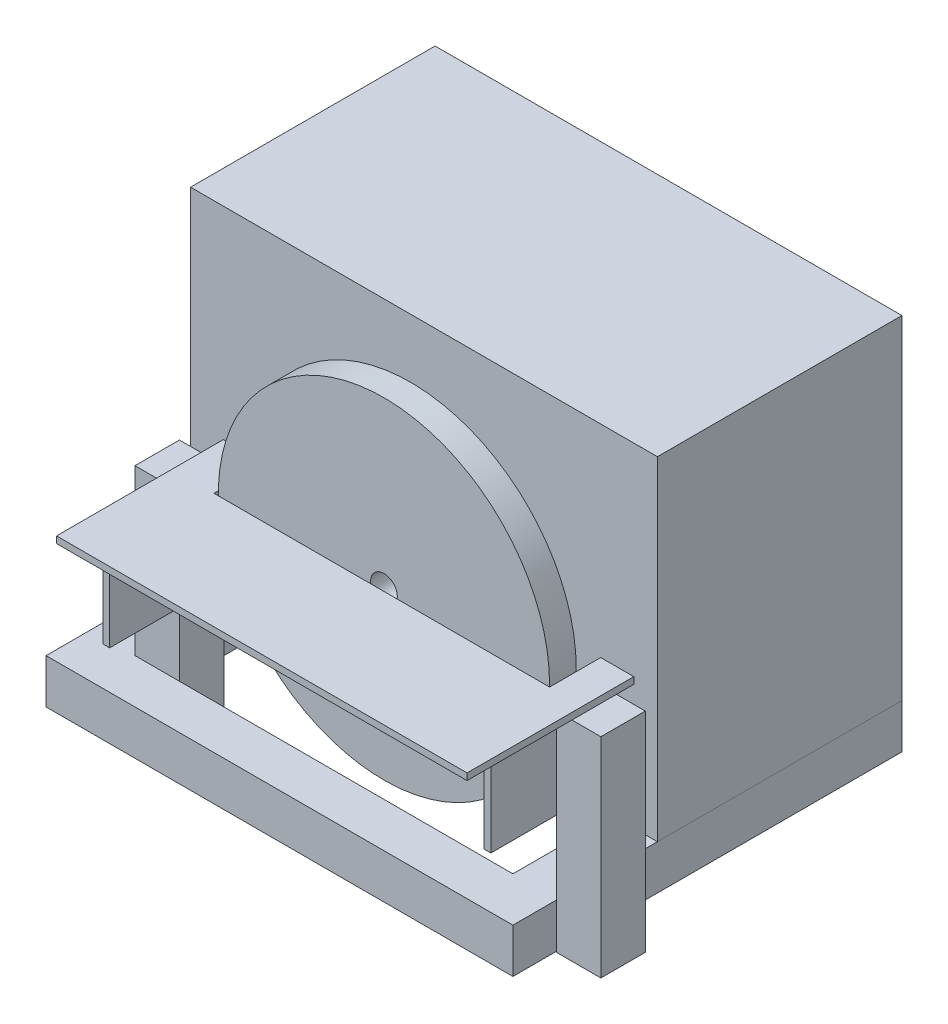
ISO-10303-21;
HEADER;
FILE_DESCRIPTION(('STEP AP214'),'2;1');
FILE_NAME('part.step','',(''),(''),'','','');
FILE_SCHEMA(('AUTOMOTIVE_DESIGN { 1 0 10303 214 1 1 1 1 }'));
ENDSEC;
DATA;
#1=APPLICATION_CONTEXT('core data for automotive mechanical design processes');
#2=APPLICATION_PROTOCOL_DEFINITION('international standard','automotive_design',2000,#1);
#3=PRODUCT_CONTEXT('',#1,'mechanical');
#4=PRODUCT('Part','Part','',(#3));
#5=PRODUCT_RELATED_PRODUCT_CATEGORY('part','',(#4));
#6=PRODUCT_DEFINITION_FORMATION('','',#4);
#7=PRODUCT_DEFINITION_CONTEXT('part definition',#1,'design');
#8=PRODUCT_DEFINITION('design','',#6,#7);
#9=PRODUCT_DEFINITION_SHAPE('','',#8);
#10=(LENGTH_UNIT() NAMED_UNIT(*) SI_UNIT(.MILLI.,.METRE.));
#11=(NAMED_UNIT(*) PLANE_ANGLE_UNIT() SI_UNIT($,.RADIAN.));
#12=(NAMED_UNIT(*) SI_UNIT($,.STERADIAN.) SOLID_ANGLE_UNIT());
#13=UNCERTAINTY_MEASURE_WITH_UNIT(LENGTH_MEASURE(1.E-05),#10,'distance_accuracy_value','');
#14=(GEOMETRIC_REPRESENTATION_CONTEXT(3) GLOBAL_UNCERTAINTY_ASSIGNED_CONTEXT((#13)) GLOBAL_UNIT_ASSIGNED_CONTEXT((#10,
#11,#12)) REPRESENTATION_CONTEXT('',''));
#15=CARTESIAN_POINT('',(0.,0.,0.));
#16=DIRECTION('',(0.,0.,1.));
#17=DIRECTION('',(1.,0.,0.));
#18=AXIS2_PLACEMENT_3D('',#15,#16,#17);
#19=CARTESIAN_POINT('',(-59.,0.,0.));
#20=DIRECTION('',(1.,0.,0.));
#21=DIRECTION('',(0.,0.,-1.));
#22=AXIS2_PLACEMENT_3D('',#19,#20,#21);
#23=PLANE('',#22);
#24=DIRECTION('',(0.,-1.,0.));
#25=VECTOR('',#24,1.);
#26=CARTESIAN_POINT('',(-59.,94.9745598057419,95.1817419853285));
#27=LINE('',#26,#25);
#28=CARTESIAN_POINT('',(-59.,94.9745598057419,95.1817419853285));
#29=VERTEX_POINT('',#28);
#30=CARTESIAN_POINT('',(-59.,87.6048613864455,95.1817419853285));
#31=VERTEX_POINT('',#30);
#32=EDGE_CURVE('E153',#29,#31,#27,.T.);
#33=ORIENTED_EDGE('',*,*,#32,.T.);
#34=DIRECTION('',(0.,0.,-1.));
#35=VECTOR('',#34,1.);
#36=CARTESIAN_POINT('',(-59.,87.6048613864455,95.1817419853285));
#37=LINE('',#36,#35);
#38=CARTESIAN_POINT('',(-59.,87.6048613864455,72.6645954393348));
#39=VERTEX_POINT('',#38);
#40=EDGE_CURVE('E156',#31,#39,#37,.T.);
#41=ORIENTED_EDGE('',*,*,#40,.T.);
#42=DIRECTION('',(0.,1.,0.));
#43=VECTOR('',#42,1.);
#44=CARTESIAN_POINT('',(-59.,94.9745598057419,72.6645954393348));
#45=LINE('',#44,#43);
#46=CARTESIAN_POINT('',(-59.,94.9745598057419,72.6645954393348));
#47=VERTEX_POINT('',#46);
#48=EDGE_CURVE('E159',#39,#47,#45,.T.);
#49=ORIENTED_EDGE('',*,*,#48,.T.);
#50=DIRECTION('',(0.,0.,1.));
#51=VECTOR('',#50,1.);
#52=CARTESIAN_POINT('',(-59.,94.9745598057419,95.1817419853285));
#53=LINE('',#52,#51);
#54=EDGE_CURVE('E161',#47,#29,#53,.T.);
#55=ORIENTED_EDGE('',*,*,#54,.T.);
#56=EDGE_LOOP('',(#33,#41,#49,#55));
#57=FACE_BOUND('',#56,.T.);
#58=DIRECTION('',(0.,0.,-1.));
#59=VECTOR('',#58,1.);
#60=CARTESIAN_POINT('',(-59.,90.6527734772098,91.1636378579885));
#61=LINE('',#60,#59);
#62=CARTESIAN_POINT('',(-59.,90.6527734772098,91.1636378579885));
#63=VERTEX_POINT('',#62);
#64=CARTESIAN_POINT('',(-59.,90.6527734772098,76.2290336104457));
#65=VERTEX_POINT('',#64);
#66=EDGE_CURVE('E125',#63,#65,#61,.T.);
#67=ORIENTED_EDGE('',*,*,#66,.F.);
#68=CARTESIAN_POINT('',(-59.,91.8150885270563,91.1636378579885));
#69=DIRECTION('',(1.,0.,0.));
#70=DIRECTION('',(0.,0.,-1.));
#71=AXIS2_PLACEMENT_3D('',#68,#69,#70);
#72=CIRCLE('',#71,1.16231504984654);
#73=CARTESIAN_POINT('',(-59.,92.9774035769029,91.1636378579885));
#74=VERTEX_POINT('',#73);
#75=EDGE_CURVE('E117',#74,#63,#72,.T.);
#76=ORIENTED_EDGE('',*,*,#75,.F.);
#77=DIRECTION('',(0.,0.,1.));
#78=VECTOR('',#77,1.);
#79=CARTESIAN_POINT('',(-59.,92.9774035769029,91.1636378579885));
#80=LINE('',#79,#78);
#81=CARTESIAN_POINT('',(-59.,92.9774035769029,76.2290336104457));
#82=VERTEX_POINT('',#81);
#83=EDGE_CURVE('E139',#82,#74,#80,.T.);
#84=ORIENTED_EDGE('',*,*,#83,.F.);
#85=CARTESIAN_POINT('',(-59.,91.8150885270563,76.2290336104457));
#86=DIRECTION('',(1.,0.,0.));
#87=DIRECTION('',(0.,0.,-1.));
#88=AXIS2_PLACEMENT_3D('',#85,#86,#87);
#89=CIRCLE('',#88,1.16231504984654);
#90=EDGE_CURVE('E137',#65,#82,#89,.T.);
#91=ORIENTED_EDGE('',*,*,#90,.F.);
#92=EDGE_LOOP('',(#67,#76,#84,#91));
#93=FACE_BOUND('',#92,.T.);
#94=ADVANCED_FACE('F52',(#57,#93),#23,.T.);
#95=CARTESIAN_POINT('',(-62.,0.,0.));
#96=DIRECTION('',(1.,0.,0.));
#97=DIRECTION('',(0.,0.,-1.));
#98=AXIS2_PLACEMENT_3D('',#95,#96,#97);
#99=PLANE('',#98);
#100=DIRECTION('',(0.,-1.,0.));
#101=VECTOR('',#100,1.);
#102=CARTESIAN_POINT('',(-62.,94.9745598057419,95.1817419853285));
#103=LINE('',#102,#101);
#104=CARTESIAN_POINT('',(-62.,94.9745598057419,95.1817419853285));
#105=VERTEX_POINT('',#104);
#106=CARTESIAN_POINT('',(-62.,87.6048613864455,95.1817419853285));
#107=VERTEX_POINT('',#106);
#108=EDGE_CURVE('E133',#105,#107,#103,.T.);
#109=ORIENTED_EDGE('',*,*,#108,.F.);
#110=DIRECTION('',(0.,0.,1.));
#111=VECTOR('',#110,1.);
#112=CARTESIAN_POINT('',(-62.,94.9745598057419,95.1817419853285));
#113=LINE('',#112,#111);
#114=CARTESIAN_POINT('',(-62.,94.9745598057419,72.6645954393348));
#115=VERTEX_POINT('',#114);
#116=EDGE_CURVE('E157',#115,#105,#113,.T.);
#117=ORIENTED_EDGE('',*,*,#116,.F.);
#118=DIRECTION('',(0.,1.,0.));
#119=VECTOR('',#118,1.);
#120=CARTESIAN_POINT('',(-62.,94.9745598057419,72.6645954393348));
#121=LINE('',#120,#119);
#122=CARTESIAN_POINT('',(-62.,87.6048613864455,72.6645954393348));
#123=VERTEX_POINT('',#122);
#124=EDGE_CURVE('E168',#123,#115,#121,.T.);
#125=ORIENTED_EDGE('',*,*,#124,.F.);
#126=DIRECTION('',(0.,0.,-1.));
#127=VECTOR('',#126,1.);
#128=CARTESIAN_POINT('',(-62.,87.6048613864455,95.1817419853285));
#129=LINE('',#128,#127);
#130=EDGE_CURVE('E166',#107,#123,#129,.T.);
#131=ORIENTED_EDGE('',*,*,#130,.F.);
#132=EDGE_LOOP('',(#109,#117,#125,#131));
#133=FACE_BOUND('',#132,.T.);
#134=CARTESIAN_POINT('',(-62.,91.8150885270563,91.1636378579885));
#135=DIRECTION('',(1.,0.,0.));
#136=DIRECTION('',(0.,0.,-1.));
#137=AXIS2_PLACEMENT_3D('',#134,#135,#136);
#138=CIRCLE('',#137,1.16231504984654);
#139=CARTESIAN_POINT('',(-62.,92.9774035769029,91.1636378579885));
#140=VERTEX_POINT('',#139);
#141=CARTESIAN_POINT('',(-62.,90.6527734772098,91.1636378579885));
#142=VERTEX_POINT('',#141);
#143=EDGE_CURVE('E75',#140,#142,#138,.T.);
#144=ORIENTED_EDGE('',*,*,#143,.T.);
#145=DIRECTION('',(0.,0.,-1.));
#146=VECTOR('',#145,1.);
#147=CARTESIAN_POINT('',(-62.,90.6527734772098,91.1636378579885));
#148=LINE('',#147,#146);
#149=CARTESIAN_POINT('',(-62.,90.6527734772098,76.2290336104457));
#150=VERTEX_POINT('',#149);
#151=EDGE_CURVE('E132',#142,#150,#148,.T.);
#152=ORIENTED_EDGE('',*,*,#151,.T.);
#153=CARTESIAN_POINT('',(-62.,91.8150885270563,76.2290336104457));
#154=DIRECTION('',(1.,0.,0.));
#155=DIRECTION('',(0.,0.,-1.));
#156=AXIS2_PLACEMENT_3D('',#153,#154,#155);
#157=CIRCLE('',#156,1.16231504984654);
#158=CARTESIAN_POINT('',(-62.,92.9774035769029,76.2290336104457));
#159=VERTEX_POINT('',#158);
#160=EDGE_CURVE('E145',#150,#159,#157,.T.);
#161=ORIENTED_EDGE('',*,*,#160,.T.);
#162=DIRECTION('',(0.,0.,1.));
#163=VECTOR('',#162,1.);
#164=CARTESIAN_POINT('',(-62.,92.9774035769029,91.1636378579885));
#165=LINE('',#164,#163);
#166=EDGE_CURVE('E126',#159,#140,#165,.T.);
#167=ORIENTED_EDGE('',*,*,#166,.T.);
#168=EDGE_LOOP('',(#144,#152,#161,#167));
#169=FACE_BOUND('',#168,.T.);
#170=ADVANCED_FACE('F186',(#133,#169),#99,.F.);
#171=CARTESIAN_POINT('',(-59.,94.9745598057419,95.1817419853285));
#172=DIRECTION('',(0.,0.,-1.));
#173=DIRECTION('',(-1.,0.,0.));
#174=AXIS2_PLACEMENT_3D('',#171,#172,#173);
#175=PLANE('',#174);
#176=ORIENTED_EDGE('',*,*,#108,.T.);
#177=DIRECTION('',(-1.,0.,0.));
#178=VECTOR('',#177,1.);
#179=CARTESIAN_POINT('',(-59.,87.6048613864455,95.1817419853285));
#180=LINE('',#179,#178);
#181=EDGE_CURVE('E12',#31,#107,#180,.T.);
#182=ORIENTED_EDGE('',*,*,#181,.F.);
#183=ORIENTED_EDGE('',*,*,#32,.F.);
#184=DIRECTION('',(-1.,0.,0.));
#185=VECTOR('',#184,1.);
#186=CARTESIAN_POINT('',(-59.,94.9745598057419,95.1817419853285));
#187=LINE('',#186,#185);
#188=EDGE_CURVE('E163',#29,#105,#187,.T.);
#189=ORIENTED_EDGE('',*,*,#188,.T.);
#190=EDGE_LOOP('',(#176,#182,#183,#189));
#191=FACE_BOUND('',#190,.T.);
#192=ADVANCED_FACE('F54',(#191),#175,.F.);
#193=CARTESIAN_POINT('',(-59.,87.6048613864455,95.1817419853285));
#194=DIRECTION('',(0.,1.,0.));
#195=DIRECTION('',(0.,0.,1.));
#196=AXIS2_PLACEMENT_3D('',#193,#194,#195);
#197=PLANE('',#196);
#198=ORIENTED_EDGE('',*,*,#130,.T.);
#199=DIRECTION('',(-1.,0.,0.));
#200=VECTOR('',#199,1.);
#201=CARTESIAN_POINT('',(-59.,87.6048613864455,72.6645954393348));
#202=LINE('',#201,#200);
#203=EDGE_CURVE('E60',#39,#123,#202,.T.);
#204=ORIENTED_EDGE('',*,*,#203,.F.);
#205=ORIENTED_EDGE('',*,*,#40,.F.);
#206=ORIENTED_EDGE('',*,*,#181,.T.);
#207=EDGE_LOOP('',(#198,#204,#205,#206));
#208=FACE_BOUND('',#207,.T.);
#209=ADVANCED_FACE('F196',(#208),#197,.F.);
#210=CARTESIAN_POINT('',(-59.,94.9745598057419,72.6645954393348));
#211=DIRECTION('',(0.,0.,1.));
#212=DIRECTION('',(1.,0.,0.));
#213=AXIS2_PLACEMENT_3D('',#210,#211,#212);
#214=PLANE('',#213);
#215=ORIENTED_EDGE('',*,*,#124,.T.);
#216=DIRECTION('',(-1.,0.,0.));
#217=VECTOR('',#216,1.);
#218=CARTESIAN_POINT('',(-59.,94.9745598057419,72.6645954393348));
#219=LINE('',#218,#217);
#220=EDGE_CURVE('E173',#47,#115,#219,.T.);
#221=ORIENTED_EDGE('',*,*,#220,.F.);
#222=ORIENTED_EDGE('',*,*,#48,.F.);
#223=ORIENTED_EDGE('',*,*,#203,.T.);
#224=EDGE_LOOP('',(#215,#221,#222,#223));
#225=FACE_BOUND('',#224,.T.);
#226=ADVANCED_FACE('F180',(#225),#214,.F.);
#227=CARTESIAN_POINT('',(-59.,94.9745598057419,95.1817419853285));
#228=DIRECTION('',(0.,-1.,0.));
#229=DIRECTION('',(0.,0.,-1.));
#230=AXIS2_PLACEMENT_3D('',#227,#228,#229);
#231=PLANE('',#230);
#232=ORIENTED_EDGE('',*,*,#116,.T.);
#233=ORIENTED_EDGE('',*,*,#188,.F.);
#234=ORIENTED_EDGE('',*,*,#54,.F.);
#235=ORIENTED_EDGE('',*,*,#220,.T.);
#236=EDGE_LOOP('',(#232,#233,#234,#235));
#237=FACE_BOUND('',#236,.T.);
#238=ADVANCED_FACE('F190',(#237),#231,.F.);
#239=CARTESIAN_POINT('',(-59.,91.8150885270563,91.1636378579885));
#240=DIRECTION('',(-1.,0.,0.));
#241=DIRECTION('',(0.,0.,1.));
#242=AXIS2_PLACEMENT_3D('',#239,#240,#241);
#243=CYLINDRICAL_SURFACE('',#242,1.16231504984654);
#244=ORIENTED_EDGE('',*,*,#143,.F.);
#245=DIRECTION('',(-1.,0.,0.));
#246=VECTOR('',#245,1.);
#247=CARTESIAN_POINT('',(-59.,92.9774035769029,91.1636378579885));
#248=LINE('',#247,#246);
#249=EDGE_CURVE('E121',#74,#140,#248,.T.);
#250=ORIENTED_EDGE('',*,*,#249,.F.);
#251=ORIENTED_EDGE('',*,*,#75,.T.);
#252=DIRECTION('',(-1.,0.,0.));
#253=VECTOR('',#252,1.);
#254=CARTESIAN_POINT('',(-59.,90.6527734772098,91.1636378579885));
#255=LINE('',#254,#253);
#256=EDGE_CURVE('E120',#63,#142,#255,.T.);
#257=ORIENTED_EDGE('',*,*,#256,.T.);
#258=EDGE_LOOP('',(#244,#250,#251,#257));
#259=FACE_BOUND('',#258,.T.);
#260=ADVANCED_FACE('F119',(#259),#243,.F.);
#261=CARTESIAN_POINT('',(-59.,90.6527734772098,91.1636378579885));
#262=DIRECTION('',(0.,1.,0.));
#263=DIRECTION('',(0.,0.,1.));
#264=AXIS2_PLACEMENT_3D('',#261,#262,#263);
#265=PLANE('',#264);
#266=ORIENTED_EDGE('',*,*,#151,.F.);
#267=ORIENTED_EDGE('',*,*,#256,.F.);
#268=ORIENTED_EDGE('',*,*,#66,.T.);
#269=DIRECTION('',(-1.,0.,0.));
#270=VECTOR('',#269,1.);
#271=CARTESIAN_POINT('',(-59.,90.6527734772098,76.2290336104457));
#272=LINE('',#271,#270);
#273=EDGE_CURVE('E134',#65,#150,#272,.T.);
#274=ORIENTED_EDGE('',*,*,#273,.T.);
#275=EDGE_LOOP('',(#266,#267,#268,#274));
#276=FACE_BOUND('',#275,.T.);
#277=ADVANCED_FACE('F129',(#276),#265,.T.);
#278=CARTESIAN_POINT('',(-59.,91.8150885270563,76.2290336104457));
#279=DIRECTION('',(-1.,0.,0.));
#280=DIRECTION('',(0.,0.,1.));
#281=AXIS2_PLACEMENT_3D('',#278,#279,#280);
#282=CYLINDRICAL_SURFACE('',#281,1.16231504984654);
#283=ORIENTED_EDGE('',*,*,#160,.F.);
#284=ORIENTED_EDGE('',*,*,#273,.F.);
#285=ORIENTED_EDGE('',*,*,#90,.T.);
#286=DIRECTION('',(-1.,0.,0.));
#287=VECTOR('',#286,1.);
#288=CARTESIAN_POINT('',(-59.,92.9774035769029,76.2290336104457));
#289=LINE('',#288,#287);
#290=EDGE_CURVE('E67',#82,#159,#289,.T.);
#291=ORIENTED_EDGE('',*,*,#290,.T.);
#292=EDGE_LOOP('',(#283,#284,#285,#291));
#293=FACE_BOUND('',#292,.T.);
#294=ADVANCED_FACE('F219',(#293),#282,.F.);
#295=CARTESIAN_POINT('',(-59.,92.9774035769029,91.1636378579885));
#296=DIRECTION('',(0.,-1.,0.));
#297=DIRECTION('',(0.,0.,-1.));
#298=AXIS2_PLACEMENT_3D('',#295,#296,#297);
#299=PLANE('',#298);
#300=ORIENTED_EDGE('',*,*,#166,.F.);
#301=ORIENTED_EDGE('',*,*,#290,.F.);
#302=ORIENTED_EDGE('',*,*,#83,.T.);
#303=ORIENTED_EDGE('',*,*,#249,.T.);
#304=EDGE_LOOP('',(#300,#301,#302,#303));
#305=FACE_BOUND('',#304,.T.);
#306=ADVANCED_FACE('F223',(#305),#299,.T.);
#307=CLOSED_SHELL('',(#94,#170,#192,#209,#226,#238,#260,#277,#294,#306));
#308=MANIFOLD_SOLID_BREP('B2',#307);
#309=CARTESIAN_POINT('',(-62.,94.7354920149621,101.906596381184));
#310=DIRECTION('',(0.,0.,-1.));
#311=DIRECTION('',(-1.,0.,0.));
#312=AXIS2_PLACEMENT_3D('',#309,#310,#311);
#313=PLANE('',#312);
#314=DIRECTION('',(0.,-1.,0.));
#315=VECTOR('',#314,1.);
#316=CARTESIAN_POINT('',(-65.,94.7354920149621,101.906596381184));
#317=LINE('',#316,#315);
#318=CARTESIAN_POINT('',(-65.,94.7354920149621,101.906596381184));
#319=VERTEX_POINT('',#318);
#320=CARTESIAN_POINT('',(-65.,51.7250743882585,101.906596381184));
#321=VERTEX_POINT('',#320);
#322=EDGE_CURVE('E355',#319,#321,#317,.T.);
#323=ORIENTED_EDGE('',*,*,#322,.T.);
#324=DIRECTION('',(-1.,0.,0.));
#325=VECTOR('',#324,1.);
#326=CARTESIAN_POINT('',(-62.,51.7250743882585,101.906596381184));
#327=LINE('',#326,#325);
#328=CARTESIAN_POINT('',(-62.,51.7250743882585,101.906596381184));
#329=VERTEX_POINT('',#328);
#330=EDGE_CURVE('E50',#329,#321,#327,.T.);
#331=ORIENTED_EDGE('',*,*,#330,.F.);
#332=DIRECTION('',(0.,-1.,0.));
#333=VECTOR('',#332,1.);
#334=CARTESIAN_POINT('',(-62.,94.7354920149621,101.906596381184));
#335=LINE('',#334,#333);
#336=CARTESIAN_POINT('',(-62.,94.7354920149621,101.906596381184));
#337=VERTEX_POINT('',#336);
#338=EDGE_CURVE('E343',#337,#329,#335,.T.);
#339=ORIENTED_EDGE('',*,*,#338,.F.);
#340=DIRECTION('',(-1.,0.,0.));
#341=VECTOR('',#340,1.);
#342=CARTESIAN_POINT('',(-62.,94.7354920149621,101.906596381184));
#343=LINE('',#342,#341);
#344=EDGE_CURVE('E351',#337,#319,#343,.T.);
#345=ORIENTED_EDGE('',*,*,#344,.T.);
#346=EDGE_LOOP('',(#323,#331,#339,#345));
#347=FACE_BOUND('',#346,.T.);
#348=ADVANCED_FACE('F292',(#347),#313,.F.);
#349=CARTESIAN_POINT('',(-62.,51.7250743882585,101.906596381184));
#350=DIRECTION('',(0.,1.,0.));
#351=DIRECTION('',(-1.,0.,0.));
#352=AXIS2_PLACEMENT_3D('',#349,#350,#351);
#353=PLANE('',#352);
#354=DIRECTION('',(0.,0.,-1.));
#355=VECTOR('',#354,1.);
#356=CARTESIAN_POINT('',(-65.,51.7250743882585,101.906596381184));
#357=LINE('',#356,#355);
#358=CARTESIAN_POINT('',(-65.,51.7250743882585,33.1171922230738));
#359=VERTEX_POINT('',#358);
#360=EDGE_CURVE('E347',#321,#359,#357,.T.);
#361=ORIENTED_EDGE('',*,*,#360,.T.);
#362=DIRECTION('',(-1.,0.,0.));
#363=VECTOR('',#362,1.);
#364=CARTESIAN_POINT('',(-62.,51.7250743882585,33.1171922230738));
#365=LINE('',#364,#363);
#366=CARTESIAN_POINT('',(-62.,51.7250743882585,33.1171922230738));
#367=VERTEX_POINT('',#366);
#368=EDGE_CURVE('E300',#367,#359,#365,.T.);
#369=ORIENTED_EDGE('',*,*,#368,.F.);
#370=DIRECTION('',(0.,0.,-1.));
#371=VECTOR('',#370,1.);
#372=CARTESIAN_POINT('',(-62.,51.7250743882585,101.906596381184));
#373=LINE('',#372,#371);
#374=EDGE_CURVE('E338',#329,#367,#373,.T.);
#375=ORIENTED_EDGE('',*,*,#374,.F.);
#376=ORIENTED_EDGE('',*,*,#330,.T.);
#377=EDGE_LOOP('',(#361,#369,#375,#376));
#378=FACE_BOUND('',#377,.T.);
#379=ADVANCED_FACE('F346',(#378),#353,.F.);
#380=CARTESIAN_POINT('',(-62.,94.7354920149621,33.1171922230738));
#381=DIRECTION('',(0.,0.,1.));
#382=DIRECTION('',(1.,0.,0.));
#383=AXIS2_PLACEMENT_3D('',#380,#381,#382);
#384=PLANE('',#383);
#385=DIRECTION('',(0.,1.,0.));
#386=VECTOR('',#385,1.);
#387=CARTESIAN_POINT('',(-65.,94.7354920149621,33.1171922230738));
#388=LINE('',#387,#386);
#389=CARTESIAN_POINT('',(-65.,94.7354920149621,33.1171922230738));
#390=VERTEX_POINT('',#389);
#391=EDGE_CURVE('E325',#359,#390,#388,.T.);
#392=ORIENTED_EDGE('',*,*,#391,.T.);
#393=DIRECTION('',(-1.,0.,0.));
#394=VECTOR('',#393,1.);
#395=CARTESIAN_POINT('',(-62.,94.7354920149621,33.1171922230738));
#396=LINE('',#395,#394);
#397=CARTESIAN_POINT('',(-62.,94.7354920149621,33.1171922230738));
#398=VERTEX_POINT('',#397);
#399=EDGE_CURVE('E348',#398,#390,#396,.T.);
#400=ORIENTED_EDGE('',*,*,#399,.F.);
#401=DIRECTION('',(0.,1.,0.));
#402=VECTOR('',#401,1.);
#403=CARTESIAN_POINT('',(-62.,94.7354920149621,33.1171922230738));
#404=LINE('',#403,#402);
#405=EDGE_CURVE('E341',#367,#398,#404,.T.);
#406=ORIENTED_EDGE('',*,*,#405,.F.);
#407=ORIENTED_EDGE('',*,*,#368,.T.);
#408=EDGE_LOOP('',(#392,#400,#406,#407));
#409=FACE_BOUND('',#408,.T.);
#410=ADVANCED_FACE('F349',(#409),#384,.F.);
#411=CARTESIAN_POINT('',(-62.,94.7354920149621,101.906596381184));
#412=DIRECTION('',(0.,-1.,0.));
#413=DIRECTION('',(1.,0.,0.));
#414=AXIS2_PLACEMENT_3D('',#411,#412,#413);
#415=PLANE('',#414);
#416=DIRECTION('',(0.,0.,1.));
#417=VECTOR('',#416,1.);
#418=CARTESIAN_POINT('',(-65.,94.7354920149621,101.906596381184));
#419=LINE('',#418,#417);
#420=EDGE_CURVE('E331',#390,#319,#419,.T.);
#421=ORIENTED_EDGE('',*,*,#420,.T.);
#422=ORIENTED_EDGE('',*,*,#344,.F.);
#423=DIRECTION('',(0.,0.,1.));
#424=VECTOR('',#423,1.);
#425=CARTESIAN_POINT('',(-62.,94.7354920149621,101.906596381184));
#426=LINE('',#425,#424);
#427=EDGE_CURVE('E308',#398,#337,#426,.T.);
#428=ORIENTED_EDGE('',*,*,#427,.F.);
#429=ORIENTED_EDGE('',*,*,#399,.T.);
#430=EDGE_LOOP('',(#421,#422,#428,#429));
#431=FACE_BOUND('',#430,.T.);
#432=ADVANCED_FACE('F362',(#431),#415,.F.);
#433=CARTESIAN_POINT('',(-62.,0.,0.));
#434=DIRECTION('',(1.,0.,0.));
#435=DIRECTION('',(0.,0.,-1.));
#436=AXIS2_PLACEMENT_3D('',#433,#434,#435);
#437=PLANE('',#436);
#438=ORIENTED_EDGE('',*,*,#338,.T.);
#439=ORIENTED_EDGE('',*,*,#374,.T.);
#440=ORIENTED_EDGE('',*,*,#405,.T.);
#441=ORIENTED_EDGE('',*,*,#427,.T.);
#442=EDGE_LOOP('',(#438,#439,#440,#441));
#443=FACE_BOUND('',#442,.T.);
#444=ADVANCED_FACE('F339',(#443),#437,.T.);
#445=CARTESIAN_POINT('',(-65.,0.,0.));
#446=DIRECTION('',(1.,0.,0.));
#447=DIRECTION('',(0.,0.,-1.));
#448=AXIS2_PLACEMENT_3D('',#445,#446,#447);
#449=PLANE('',#448);
#450=ORIENTED_EDGE('',*,*,#322,.F.);
#451=ORIENTED_EDGE('',*,*,#420,.F.);
#452=ORIENTED_EDGE('',*,*,#391,.F.);
#453=ORIENTED_EDGE('',*,*,#360,.F.);
#454=EDGE_LOOP('',(#450,#451,#452,#453));
#455=FACE_BOUND('',#454,.T.);
#456=ADVANCED_FACE('F365',(#455),#449,.F.);
#457=CLOSED_SHELL('',(#348,#379,#410,#432,#444,#456));
#458=MANIFOLD_SOLID_BREP('B6',#457);
#459=CARTESIAN_POINT('',(-65.,0.,67.5));
#460=DIRECTION('',(0.,0.,1.));
#461=DIRECTION('',(1.,0.,0.));
#462=AXIS2_PLACEMENT_3D('',#459,#460,#461);
#463=PLANE('',#462);
#464=DIRECTION('',(0.,1.,0.));
#465=VECTOR('',#464,1.);
#466=CARTESIAN_POINT('',(-85.,0.,67.5));
#467=LINE('',#466,#465);
#468=CARTESIAN_POINT('',(-85.,0.,67.5));
#469=VERTEX_POINT('',#468);
#470=CARTESIAN_POINT('',(-85.,94.,67.5));
#471=VERTEX_POINT('',#470);
#472=EDGE_CURVE('E489',#469,#471,#467,.T.);
#473=ORIENTED_EDGE('',*,*,#472,.F.);
#474=DIRECTION('',(-1.,0.,0.));
#475=VECTOR('',#474,1.);
#476=CARTESIAN_POINT('',(-65.,0.,67.5));
#477=LINE('',#476,#475);
#478=CARTESIAN_POINT('',(-65.,0.,67.5));
#479=VERTEX_POINT('',#478);
#480=EDGE_CURVE('E290',#479,#469,#477,.T.);
#481=ORIENTED_EDGE('',*,*,#480,.F.);
#482=DIRECTION('',(0.,1.,0.));
#483=VECTOR('',#482,1.);
#484=CARTESIAN_POINT('',(-65.,0.,67.5));
#485=LINE('',#484,#483);
#486=CARTESIAN_POINT('',(-65.,94.,67.5));
#487=VERTEX_POINT('',#486);
#488=EDGE_CURVE('E474',#479,#487,#485,.T.);
#489=ORIENTED_EDGE('',*,*,#488,.T.);
#490=DIRECTION('',(-1.,0.,0.));
#491=VECTOR('',#490,1.);
#492=CARTESIAN_POINT('',(-65.,94.,67.5));
#493=LINE('',#492,#491);
#494=EDGE_CURVE('E442',#487,#471,#493,.T.);
#495=ORIENTED_EDGE('',*,*,#494,.T.);
#496=EDGE_LOOP('',(#473,#481,#489,#495));
#497=FACE_BOUND('',#496,.T.);
#498=ADVANCED_FACE('F426',(#497),#463,.T.);
#499=CARTESIAN_POINT('',(-65.,0.,0.));
#500=DIRECTION('',(0.,1.,0.));
#501=DIRECTION('',(0.,0.,1.));
#502=AXIS2_PLACEMENT_3D('',#499,#500,#501);
#503=PLANE('',#502);
#504=DIRECTION('',(0.,0.,-1.));
#505=VECTOR('',#504,1.);
#506=CARTESIAN_POINT('',(-85.,0.,0.));
#507=LINE('',#506,#505);
#508=CARTESIAN_POINT('',(-85.,0.,47.5));
#509=VERTEX_POINT('',#508);
#510=EDGE_CURVE('E480',#469,#509,#507,.T.);
#511=ORIENTED_EDGE('',*,*,#510,.T.);
#512=DIRECTION('',(-1.,0.,0.));
#513=VECTOR('',#512,1.);
#514=CARTESIAN_POINT('',(-65.,0.,47.5));
#515=LINE('',#514,#513);
#516=CARTESIAN_POINT('',(-65.,0.,47.5));
#517=VERTEX_POINT('',#516);
#518=EDGE_CURVE('E434',#517,#509,#515,.T.);
#519=ORIENTED_EDGE('',*,*,#518,.F.);
#520=DIRECTION('',(0.,0.,-1.));
#521=VECTOR('',#520,1.);
#522=CARTESIAN_POINT('',(-65.,0.,0.));
#523=LINE('',#522,#521);
#524=EDGE_CURVE('E468',#479,#517,#523,.T.);
#525=ORIENTED_EDGE('',*,*,#524,.F.);
#526=ORIENTED_EDGE('',*,*,#480,.T.);
#527=EDGE_LOOP('',(#511,#519,#525,#526));
#528=FACE_BOUND('',#527,.T.);
#529=ADVANCED_FACE('F478',(#528),#503,.F.);
#530=CARTESIAN_POINT('',(-65.,0.,47.5));
#531=DIRECTION('',(0.,0.,1.));
#532=DIRECTION('',(1.,0.,0.));
#533=AXIS2_PLACEMENT_3D('',#530,#531,#532);
#534=PLANE('',#533);
#535=DIRECTION('',(0.,1.,0.));
#536=VECTOR('',#535,1.);
#537=CARTESIAN_POINT('',(-85.,0.,47.5));
#538=LINE('',#537,#536);
#539=CARTESIAN_POINT('',(-85.,94.,47.5));
#540=VERTEX_POINT('',#539);
#541=EDGE_CURVE('E492',#509,#540,#538,.T.);
#542=ORIENTED_EDGE('',*,*,#541,.T.);
#543=DIRECTION('',(-1.,0.,0.));
#544=VECTOR('',#543,1.);
#545=CARTESIAN_POINT('',(-65.,94.,47.5));
#546=LINE('',#545,#544);
#547=CARTESIAN_POINT('',(-65.,94.,47.5));
#548=VERTEX_POINT('',#547);
#549=EDGE_CURVE('E456',#548,#540,#546,.T.);
#550=ORIENTED_EDGE('',*,*,#549,.F.);
#551=DIRECTION('',(0.,1.,0.));
#552=VECTOR('',#551,1.);
#553=CARTESIAN_POINT('',(-65.,0.,47.5));
#554=LINE('',#553,#552);
#555=EDGE_CURVE('E473',#517,#548,#554,.T.);
#556=ORIENTED_EDGE('',*,*,#555,.F.);
#557=ORIENTED_EDGE('',*,*,#518,.T.);
#558=EDGE_LOOP('',(#542,#550,#556,#557));
#559=FACE_BOUND('',#558,.T.);
#560=ADVANCED_FACE('F483',(#559),#534,.F.);
#561=CARTESIAN_POINT('',(-65.,94.,0.));
#562=DIRECTION('',(0.,1.,0.));
#563=DIRECTION('',(0.,0.,1.));
#564=AXIS2_PLACEMENT_3D('',#561,#562,#563);
#565=PLANE('',#564);
#566=DIRECTION('',(0.,0.,-1.));
#567=VECTOR('',#566,1.);
#568=CARTESIAN_POINT('',(-85.,94.,0.));
#569=LINE('',#568,#567);
#570=EDGE_CURVE('E494',#471,#540,#569,.T.);
#571=ORIENTED_EDGE('',*,*,#570,.F.);
#572=ORIENTED_EDGE('',*,*,#494,.F.);
#573=DIRECTION('',(0.,0.,-1.));
#574=VECTOR('',#573,1.);
#575=CARTESIAN_POINT('',(-65.,94.,0.));
#576=LINE('',#575,#574);
#577=EDGE_CURVE('E484',#487,#548,#576,.T.);
#578=ORIENTED_EDGE('',*,*,#577,.T.);
#579=ORIENTED_EDGE('',*,*,#549,.T.);
#580=EDGE_LOOP('',(#571,#572,#578,#579));
#581=FACE_BOUND('',#580,.T.);
#582=ADVANCED_FACE('F499',(#581),#565,.T.);
#583=CARTESIAN_POINT('',(-65.,0.,0.));
#584=DIRECTION('',(1.,0.,0.));
#585=DIRECTION('',(0.,0.,-1.));
#586=AXIS2_PLACEMENT_3D('',#583,#584,#585);
#587=PLANE('',#586);
#588=ORIENTED_EDGE('',*,*,#488,.F.);
#589=ORIENTED_EDGE('',*,*,#524,.T.);
#590=ORIENTED_EDGE('',*,*,#555,.T.);
#591=ORIENTED_EDGE('',*,*,#577,.F.);
#592=EDGE_LOOP('',(#588,#589,#590,#591));
#593=FACE_BOUND('',#592,.T.);
#594=ADVANCED_FACE('F470',(#593),#587,.T.);
#595=CARTESIAN_POINT('',(-85.,0.,0.));
#596=DIRECTION('',(1.,0.,0.));
#597=DIRECTION('',(0.,0.,-1.));
#598=AXIS2_PLACEMENT_3D('',#595,#596,#597);
#599=PLANE('',#598);
#600=ORIENTED_EDGE('',*,*,#472,.T.);
#601=ORIENTED_EDGE('',*,*,#570,.T.);
#602=ORIENTED_EDGE('',*,*,#541,.F.);
#603=ORIENTED_EDGE('',*,*,#510,.F.);
#604=EDGE_LOOP('',(#600,#601,#602,#603));
#605=FACE_BOUND('',#604,.T.);
#606=ADVANCED_FACE('F506',(#605),#599,.F.);
#607=CLOSED_SHELL('',(#498,#529,#560,#582,#594,#606));
#608=MANIFOLD_SOLID_BREP('B44',#607);
#609=CARTESIAN_POINT('',(125.376837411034,94.,68.3056906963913));
#610=DIRECTION('',(0.,0.,-1.));
#611=DIRECTION('',(-1.,0.,0.));
#612=AXIS2_PLACEMENT_3D('',#609,#610,#611);
#613=PLANE('',#612);
#614=DIRECTION('',(0.,-1.,0.));
#615=VECTOR('',#614,1.);
#616=CARTESIAN_POINT('',(105.376837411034,94.,68.3056906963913));
#617=LINE('',#616,#615);
#618=CARTESIAN_POINT('',(105.376837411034,94.,68.3056906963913));
#619=VERTEX_POINT('',#618);
#620=CARTESIAN_POINT('',(105.376837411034,0.,68.3056906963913));
#621=VERTEX_POINT('',#620);
#622=EDGE_CURVE('E638',#619,#621,#617,.T.);
#623=ORIENTED_EDGE('',*,*,#622,.T.);
#624=DIRECTION('',(-1.,0.,0.));
#625=VECTOR('',#624,1.);
#626=CARTESIAN_POINT('',(125.376837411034,0.,68.3056906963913));
#627=LINE('',#626,#625);
#628=CARTESIAN_POINT('',(125.376837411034,0.,68.3056906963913));
#629=VERTEX_POINT('',#628);
#630=EDGE_CURVE('E424',#629,#621,#627,.T.);
#631=ORIENTED_EDGE('',*,*,#630,.F.);
#632=DIRECTION('',(0.,-1.,0.));
#633=VECTOR('',#632,1.);
#634=CARTESIAN_POINT('',(125.376837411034,94.,68.3056906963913));
#635=LINE('',#634,#633);
#636=CARTESIAN_POINT('',(125.376837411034,94.,68.3056906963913));
#637=VERTEX_POINT('',#636);
#638=EDGE_CURVE('E626',#637,#629,#635,.T.);
#639=ORIENTED_EDGE('',*,*,#638,.F.);
#640=DIRECTION('',(-1.,0.,0.));
#641=VECTOR('',#640,1.);
#642=CARTESIAN_POINT('',(125.376837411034,94.,68.3056906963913));
#643=LINE('',#642,#641);
#644=EDGE_CURVE('E634',#637,#619,#643,.T.);
#645=ORIENTED_EDGE('',*,*,#644,.T.);
#646=EDGE_LOOP('',(#623,#631,#639,#645));
#647=FACE_BOUND('',#646,.T.);
#648=ADVANCED_FACE('F575',(#647),#613,.F.);
#649=CARTESIAN_POINT('',(125.376837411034,0.,68.3056906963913));
#650=DIRECTION('',(0.,1.,0.));
#651=DIRECTION('',(0.,0.,1.));
#652=AXIS2_PLACEMENT_3D('',#649,#650,#651);
#653=PLANE('',#652);
#654=DIRECTION('',(0.,0.,-1.));
#655=VECTOR('',#654,1.);
#656=CARTESIAN_POINT('',(105.376837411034,0.,68.3056906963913));
#657=LINE('',#656,#655);
#658=CARTESIAN_POINT('',(105.376837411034,0.,48.3056906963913));
#659=VERTEX_POINT('',#658);
#660=EDGE_CURVE('E630',#621,#659,#657,.T.);
#661=ORIENTED_EDGE('',*,*,#660,.T.);
#662=DIRECTION('',(-1.,0.,0.));
#663=VECTOR('',#662,1.);
#664=CARTESIAN_POINT('',(125.376837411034,0.,48.3056906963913));
#665=LINE('',#664,#663);
#666=CARTESIAN_POINT('',(125.376837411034,0.,48.3056906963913));
#667=VERTEX_POINT('',#666);
#668=EDGE_CURVE('E583',#667,#659,#665,.T.);
#669=ORIENTED_EDGE('',*,*,#668,.F.);
#670=DIRECTION('',(0.,0.,-1.));
#671=VECTOR('',#670,1.);
#672=CARTESIAN_POINT('',(125.376837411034,0.,68.3056906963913));
#673=LINE('',#672,#671);
#674=EDGE_CURVE('E621',#629,#667,#673,.T.);
#675=ORIENTED_EDGE('',*,*,#674,.F.);
#676=ORIENTED_EDGE('',*,*,#630,.T.);
#677=EDGE_LOOP('',(#661,#669,#675,#676));
#678=FACE_BOUND('',#677,.T.);
#679=ADVANCED_FACE('F629',(#678),#653,.F.);
#680=CARTESIAN_POINT('',(125.376837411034,94.,48.3056906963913));
#681=DIRECTION('',(0.,0.,1.));
#682=DIRECTION('',(1.,0.,0.));
#683=AXIS2_PLACEMENT_3D('',#680,#681,#682);
#684=PLANE('',#683);
#685=DIRECTION('',(0.,1.,0.));
#686=VECTOR('',#685,1.);
#687=CARTESIAN_POINT('',(105.376837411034,94.,48.3056906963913));
#688=LINE('',#687,#686);
#689=CARTESIAN_POINT('',(105.376837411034,94.,48.3056906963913));
#690=VERTEX_POINT('',#689);
#691=EDGE_CURVE('E608',#659,#690,#688,.T.);
#692=ORIENTED_EDGE('',*,*,#691,.T.);
#693=DIRECTION('',(-1.,0.,0.));
#694=VECTOR('',#693,1.);
#695=CARTESIAN_POINT('',(125.376837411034,94.,48.3056906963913));
#696=LINE('',#695,#694);
#697=CARTESIAN_POINT('',(125.376837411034,94.,48.3056906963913));
#698=VERTEX_POINT('',#697);
#699=EDGE_CURVE('E631',#698,#690,#696,.T.);
#700=ORIENTED_EDGE('',*,*,#699,.F.);
#701=DIRECTION('',(0.,1.,0.));
#702=VECTOR('',#701,1.);
#703=CARTESIAN_POINT('',(125.376837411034,94.,48.3056906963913));
#704=LINE('',#703,#702);
#705=EDGE_CURVE('E624',#667,#698,#704,.T.);
#706=ORIENTED_EDGE('',*,*,#705,.F.);
#707=ORIENTED_EDGE('',*,*,#668,.T.);
#708=EDGE_LOOP('',(#692,#700,#706,#707));
#709=FACE_BOUND('',#708,.T.);
#710=ADVANCED_FACE('F632',(#709),#684,.F.);
#711=CARTESIAN_POINT('',(125.376837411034,94.,68.3056906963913));
#712=DIRECTION('',(0.,-1.,0.));
#713=DIRECTION('',(0.,0.,-1.));
#714=AXIS2_PLACEMENT_3D('',#711,#712,#713);
#715=PLANE('',#714);
#716=DIRECTION('',(0.,0.,1.));
#717=VECTOR('',#716,1.);
#718=CARTESIAN_POINT('',(105.376837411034,94.,68.3056906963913));
#719=LINE('',#718,#717);
#720=EDGE_CURVE('E614',#690,#619,#719,.T.);
#721=ORIENTED_EDGE('',*,*,#720,.T.);
#722=ORIENTED_EDGE('',*,*,#644,.F.);
#723=DIRECTION('',(0.,0.,1.));
#724=VECTOR('',#723,1.);
#725=CARTESIAN_POINT('',(125.376837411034,94.,68.3056906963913));
#726=LINE('',#725,#724);
#727=EDGE_CURVE('E591',#698,#637,#726,.T.);
#728=ORIENTED_EDGE('',*,*,#727,.F.);
#729=ORIENTED_EDGE('',*,*,#699,.T.);
#730=EDGE_LOOP('',(#721,#722,#728,#729));
#731=FACE_BOUND('',#730,.T.);
#732=ADVANCED_FACE('F645',(#731),#715,.F.);
#733=CARTESIAN_POINT('',(125.376837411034,0.,0.));
#734=DIRECTION('',(1.,0.,0.));
#735=DIRECTION('',(0.,0.,-1.));
#736=AXIS2_PLACEMENT_3D('',#733,#734,#735);
#737=PLANE('',#736);
#738=ORIENTED_EDGE('',*,*,#638,.T.);
#739=ORIENTED_EDGE('',*,*,#674,.T.);
#740=ORIENTED_EDGE('',*,*,#705,.T.);
#741=ORIENTED_EDGE('',*,*,#727,.T.);
#742=EDGE_LOOP('',(#738,#739,#740,#741));
#743=FACE_BOUND('',#742,.T.);
#744=ADVANCED_FACE('F622',(#743),#737,.T.);
#745=CARTESIAN_POINT('',(105.376837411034,0.,0.));
#746=DIRECTION('',(1.,0.,0.));
#747=DIRECTION('',(0.,0.,-1.));
#748=AXIS2_PLACEMENT_3D('',#745,#746,#747);
#749=PLANE('',#748);
#750=ORIENTED_EDGE('',*,*,#622,.F.);
#751=ORIENTED_EDGE('',*,*,#720,.F.);
#752=ORIENTED_EDGE('',*,*,#691,.F.);
#753=ORIENTED_EDGE('',*,*,#660,.F.);
#754=EDGE_LOOP('',(#750,#751,#752,#753));
#755=FACE_BOUND('',#754,.T.);
#756=ADVANCED_FACE('F648',(#755),#749,.F.);
#757=CLOSED_SHELL('',(#648,#679,#710,#732,#744,#756));
#758=MANIFOLD_SOLID_BREP('B284',#757);
#759=CARTESIAN_POINT('',(105.376837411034,0.,0.));
#760=DIRECTION('',(1.,0.,0.));
#761=DIRECTION('',(0.,0.,-1.));
#762=AXIS2_PLACEMENT_3D('',#759,#760,#761);
#763=PLANE('',#762);
#764=DIRECTION('',(0.,-1.,0.));
#765=VECTOR('',#764,1.);
#766=CARTESIAN_POINT('',(105.376837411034,94.,97.7771611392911));
#767=LINE('',#766,#765);
#768=CARTESIAN_POINT('',(105.376837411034,94.,97.7771611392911));
#769=VERTEX_POINT('',#768);
#770=CARTESIAN_POINT('',(105.376837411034,53.4220082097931,97.7771611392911));
#771=VERTEX_POINT('',#770);
#772=EDGE_CURVE('E805',#769,#771,#767,.T.);
#773=ORIENTED_EDGE('',*,*,#772,.T.);
#774=DIRECTION('',(0.,0.,-1.));
#775=VECTOR('',#774,1.);
#776=CARTESIAN_POINT('',(105.376837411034,53.4220082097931,97.7771611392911));
#777=LINE('',#776,#775);
#778=CARTESIAN_POINT('',(105.376837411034,53.4220082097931,38.4192964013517));
#779=VERTEX_POINT('',#778);
#780=EDGE_CURVE('E763',#771,#779,#777,.T.);
#781=ORIENTED_EDGE('',*,*,#780,.T.);
#782=DIRECTION('',(0.,1.,0.));
#783=VECTOR('',#782,1.);
#784=CARTESIAN_POINT('',(105.376837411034,53.4220082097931,38.4192964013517));
#785=LINE('',#784,#783);
#786=CARTESIAN_POINT('',(105.376837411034,74.4331762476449,38.4192964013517));
#787=VERTEX_POINT('',#786);
#788=EDGE_CURVE('E776',#779,#787,#785,.T.);
#789=ORIENTED_EDGE('',*,*,#788,.T.);
#790=DIRECTION('',(0.,0.,1.));
#791=VECTOR('',#790,1.);
#792=CARTESIAN_POINT('',(105.376837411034,74.4331762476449,38.4192964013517));
#793=LINE('',#792,#791);
#794=CARTESIAN_POINT('',(105.376837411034,74.4331762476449,53.6943863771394));
#795=VERTEX_POINT('',#794);
#796=EDGE_CURVE('E770',#787,#795,#793,.T.);
#797=ORIENTED_EDGE('',*,*,#796,.T.);
#798=DIRECTION('',(0.,1.,0.));
#799=VECTOR('',#798,1.);
#800=CARTESIAN_POINT('',(105.376837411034,74.4331762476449,53.6943863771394));
#801=LINE('',#800,#799);
#802=CARTESIAN_POINT('',(105.376837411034,94.,53.6943863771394));
#803=VERTEX_POINT('',#802);
#804=EDGE_CURVE('E774',#795,#803,#801,.T.);
#805=ORIENTED_EDGE('',*,*,#804,.T.);
#806=DIRECTION('',(0.,0.,1.));
#807=VECTOR('',#806,1.);
#808=CARTESIAN_POINT('',(105.376837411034,94.,97.7771611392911));
#809=LINE('',#808,#807);
#810=EDGE_CURVE('E726',#803,#769,#809,.T.);
#811=ORIENTED_EDGE('',*,*,#810,.T.);
#812=EDGE_LOOP('',(#773,#781,#789,#797,#805,#811));
#813=FACE_BOUND('',#812,.T.);
#814=CARTESIAN_POINT('',(105.376837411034,88.9538739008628,58.1189784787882));
#815=DIRECTION('',(1.,0.,0.));
#816=DIRECTION('',(0.,0.,-1.));
#817=AXIS2_PLACEMENT_3D('',#814,#815,#816);
#818=CIRCLE('',#817,2.42485363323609);
#819=CARTESIAN_POINT('',(105.376837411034,88.9538739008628,55.6941248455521));
#820=VERTEX_POINT('',#819);
#821=EDGE_CURVE('E798',#820,#820,#818,.T.);
#822=ORIENTED_EDGE('',*,*,#821,.F.);
#823=EDGE_LOOP('',(#822));
#824=FACE_BOUND('',#823,.T.);
#825=ADVANCED_FACE('F709',(#813,#824),#763,.T.);
#826=CARTESIAN_POINT('',(102.376837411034,0.,0.));
#827=DIRECTION('',(1.,0.,0.));
#828=DIRECTION('',(0.,0.,-1.));
#829=AXIS2_PLACEMENT_3D('',#826,#827,#828);
#830=PLANE('',#829);
#831=DIRECTION('',(0.,-1.,0.));
#832=VECTOR('',#831,1.);
#833=CARTESIAN_POINT('',(102.376837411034,94.,97.7771611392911));
#834=LINE('',#833,#832);
#835=CARTESIAN_POINT('',(102.376837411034,94.,97.7771611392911));
#836=VERTEX_POINT('',#835);
#837=CARTESIAN_POINT('',(102.376837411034,53.4220082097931,97.7771611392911));
#838=VERTEX_POINT('',#837);
#839=EDGE_CURVE('E794',#836,#838,#834,.T.);
#840=ORIENTED_EDGE('',*,*,#839,.F.);
#841=DIRECTION('',(0.,0.,1.));
#842=VECTOR('',#841,1.);
#843=CARTESIAN_POINT('',(102.376837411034,94.,97.7771611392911));
#844=LINE('',#843,#842);
#845=CARTESIAN_POINT('',(102.376837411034,94.,53.6943863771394));
#846=VERTEX_POINT('',#845);
#847=EDGE_CURVE('E755',#846,#836,#844,.T.);
#848=ORIENTED_EDGE('',*,*,#847,.F.);
#849=DIRECTION('',(0.,1.,0.));
#850=VECTOR('',#849,1.);
#851=CARTESIAN_POINT('',(102.376837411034,74.4331762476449,53.6943863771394));
#852=LINE('',#851,#850);
#853=CARTESIAN_POINT('',(102.376837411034,74.4331762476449,53.6943863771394));
#854=VERTEX_POINT('',#853);
#855=EDGE_CURVE('E749',#854,#846,#852,.T.);
#856=ORIENTED_EDGE('',*,*,#855,.F.);
#857=DIRECTION('',(0.,0.,1.));
#858=VECTOR('',#857,1.);
#859=CARTESIAN_POINT('',(102.376837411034,74.4331762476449,38.4192964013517));
#860=LINE('',#859,#858);
#861=CARTESIAN_POINT('',(102.376837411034,74.4331762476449,38.4192964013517));
#862=VERTEX_POINT('',#861);
#863=EDGE_CURVE('E784',#862,#854,#860,.T.);
#864=ORIENTED_EDGE('',*,*,#863,.F.);
#865=DIRECTION('',(0.,1.,0.));
#866=VECTOR('',#865,1.);
#867=CARTESIAN_POINT('',(102.376837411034,53.4220082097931,38.4192964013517));
#868=LINE('',#867,#866);
#869=CARTESIAN_POINT('',(102.376837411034,53.4220082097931,38.4192964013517));
#870=VERTEX_POINT('',#869);
#871=EDGE_CURVE('E800',#870,#862,#868,.T.);
#872=ORIENTED_EDGE('',*,*,#871,.F.);
#873=DIRECTION('',(0.,0.,-1.));
#874=VECTOR('',#873,1.);
#875=CARTESIAN_POINT('',(102.376837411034,53.4220082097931,53.6943863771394));
#876=LINE('',#875,#874);
#877=EDGE_CURVE('E797',#838,#870,#876,.T.);
#878=ORIENTED_EDGE('',*,*,#877,.F.);
#879=EDGE_LOOP('',(#840,#848,#856,#864,#872,#878));
#880=FACE_BOUND('',#879,.T.);
#881=CARTESIAN_POINT('',(102.376837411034,88.9538739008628,58.1189784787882));
#882=DIRECTION('',(1.,0.,0.));
#883=DIRECTION('',(0.,0.,-1.));
#884=AXIS2_PLACEMENT_3D('',#881,#882,#883);
#885=CIRCLE('',#884,2.42485363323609);
#886=CARTESIAN_POINT('',(102.376837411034,88.9538739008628,55.6941248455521));
#887=VERTEX_POINT('',#886);
#888=EDGE_CURVE('E901',#887,#887,#885,.T.);
#889=ORIENTED_EDGE('',*,*,#888,.T.);
#890=EDGE_LOOP('',(#889));
#891=FACE_BOUND('',#890,.T.);
#892=ADVANCED_FACE('F814',(#880,#891),#830,.F.);
#893=CARTESIAN_POINT('',(105.376837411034,94.,97.7771611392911));
#894=DIRECTION('',(0.,0.,-1.));
#895=DIRECTION('',(-1.,0.,0.));
#896=AXIS2_PLACEMENT_3D('',#893,#894,#895);
#897=PLANE('',#896);
#898=ORIENTED_EDGE('',*,*,#839,.T.);
#899=DIRECTION('',(-1.,0.,0.));
#900=VECTOR('',#899,1.);
#901=CARTESIAN_POINT('',(105.376837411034,53.4220082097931,97.7771611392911));
#902=LINE('',#901,#900);
#903=EDGE_CURVE('E573',#771,#838,#902,.T.);
#904=ORIENTED_EDGE('',*,*,#903,.F.);
#905=ORIENTED_EDGE('',*,*,#772,.F.);
#906=DIRECTION('',(-1.,0.,0.));
#907=VECTOR('',#906,1.);
#908=CARTESIAN_POINT('',(105.376837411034,94.,97.7771611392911));
#909=LINE('',#908,#907);
#910=EDGE_CURVE('E790',#769,#836,#909,.T.);
#911=ORIENTED_EDGE('',*,*,#910,.T.);
#912=EDGE_LOOP('',(#898,#904,#905,#911));
#913=FACE_BOUND('',#912,.T.);
#914=ADVANCED_FACE('F711',(#913),#897,.F.);
#915=CARTESIAN_POINT('',(105.376837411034,53.4220082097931,53.6943863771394));
#916=DIRECTION('',(0.,1.,0.));
#917=DIRECTION('',(0.,0.,1.));
#918=AXIS2_PLACEMENT_3D('',#915,#916,#917);
#919=PLANE('',#918);
#920=ORIENTED_EDGE('',*,*,#877,.T.);
#921=DIRECTION('',(-1.,0.,0.));
#922=VECTOR('',#921,1.);
#923=CARTESIAN_POINT('',(105.376837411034,53.4220082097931,38.4192964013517));
#924=LINE('',#923,#922);
#925=EDGE_CURVE('E718',#779,#870,#924,.T.);
#926=ORIENTED_EDGE('',*,*,#925,.F.);
#927=ORIENTED_EDGE('',*,*,#780,.F.);
#928=ORIENTED_EDGE('',*,*,#903,.T.);
#929=EDGE_LOOP('',(#920,#926,#927,#928));
#930=FACE_BOUND('',#929,.T.);
#931=ADVANCED_FACE('F839',(#930),#919,.F.);
#932=CARTESIAN_POINT('',(105.376837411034,53.4220082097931,38.4192964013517));
#933=DIRECTION('',(0.,0.,1.));
#934=DIRECTION('',(1.,0.,0.));
#935=AXIS2_PLACEMENT_3D('',#932,#933,#934);
#936=PLANE('',#935);
#937=ORIENTED_EDGE('',*,*,#871,.T.);
#938=DIRECTION('',(-1.,0.,0.));
#939=VECTOR('',#938,1.);
#940=CARTESIAN_POINT('',(105.376837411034,74.4331762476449,38.4192964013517));
#941=LINE('',#940,#939);
#942=EDGE_CURVE('E785',#787,#862,#941,.T.);
#943=ORIENTED_EDGE('',*,*,#942,.F.);
#944=ORIENTED_EDGE('',*,*,#788,.F.);
#945=ORIENTED_EDGE('',*,*,#925,.T.);
#946=EDGE_LOOP('',(#937,#943,#944,#945));
#947=FACE_BOUND('',#946,.T.);
#948=ADVANCED_FACE('F811',(#947),#936,.F.);
#949=CARTESIAN_POINT('',(105.376837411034,74.4331762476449,38.4192964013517));
#950=DIRECTION('',(0.,-1.,0.));
#951=DIRECTION('',(0.,0.,-1.));
#952=AXIS2_PLACEMENT_3D('',#949,#950,#951);
#953=PLANE('',#952);
#954=ORIENTED_EDGE('',*,*,#863,.T.);
#955=DIRECTION('',(-1.,0.,0.));
#956=VECTOR('',#955,1.);
#957=CARTESIAN_POINT('',(105.376837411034,74.4331762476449,53.6943863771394));
#958=LINE('',#957,#956);
#959=EDGE_CURVE('E781',#795,#854,#958,.T.);
#960=ORIENTED_EDGE('',*,*,#959,.F.);
#961=ORIENTED_EDGE('',*,*,#796,.F.);
#962=ORIENTED_EDGE('',*,*,#942,.T.);
#963=EDGE_LOOP('',(#954,#960,#961,#962));
#964=FACE_BOUND('',#963,.T.);
#965=ADVANCED_FACE('F782',(#964),#953,.F.);
#966=CARTESIAN_POINT('',(105.376837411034,74.4331762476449,53.6943863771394));
#967=DIRECTION('',(0.,0.,1.));
#968=DIRECTION('',(1.,0.,0.));
#969=AXIS2_PLACEMENT_3D('',#966,#967,#968);
#970=PLANE('',#969);
#971=ORIENTED_EDGE('',*,*,#855,.T.);
#972=DIRECTION('',(-1.,0.,0.));
#973=VECTOR('',#972,1.);
#974=CARTESIAN_POINT('',(105.376837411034,94.,53.6943863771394));
#975=LINE('',#974,#973);
#976=EDGE_CURVE('E786',#803,#846,#975,.T.);
#977=ORIENTED_EDGE('',*,*,#976,.F.);
#978=ORIENTED_EDGE('',*,*,#804,.F.);
#979=ORIENTED_EDGE('',*,*,#959,.T.);
#980=EDGE_LOOP('',(#971,#977,#978,#979));
#981=FACE_BOUND('',#980,.T.);
#982=ADVANCED_FACE('F788',(#981),#970,.F.);
#983=CARTESIAN_POINT('',(105.376837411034,94.,97.7771611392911));
#984=DIRECTION('',(0.,-1.,0.));
#985=DIRECTION('',(0.,0.,-1.));
#986=AXIS2_PLACEMENT_3D('',#983,#984,#985);
#987=PLANE('',#986);
#988=ORIENTED_EDGE('',*,*,#847,.T.);
#989=ORIENTED_EDGE('',*,*,#910,.F.);
#990=ORIENTED_EDGE('',*,*,#810,.F.);
#991=ORIENTED_EDGE('',*,*,#976,.T.);
#992=EDGE_LOOP('',(#988,#989,#990,#991));
#993=FACE_BOUND('',#992,.T.);
#994=ADVANCED_FACE('F819',(#993),#987,.F.);
#995=CARTESIAN_POINT('',(105.376837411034,88.9538739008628,58.1189784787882));
#996=DIRECTION('',(-1.,0.,0.));
#997=DIRECTION('',(0.,0.,1.));
#998=AXIS2_PLACEMENT_3D('',#995,#996,#997);
#999=CYLINDRICAL_SURFACE('',#998,2.42485363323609);
#1000=ORIENTED_EDGE('',*,*,#821,.T.);
#1001=EDGE_LOOP('',(#1000));
#1002=FACE_BOUND('',#1001,.T.);
#1003=ORIENTED_EDGE('',*,*,#888,.F.);
#1004=EDGE_LOOP('',(#1003));
#1005=FACE_BOUND('',#1004,.T.);
#1006=ADVANCED_FACE('F821',(#1002,#1005),#999,.F.);
#1007=CLOSED_SHELL('',(#825,#892,#914,#931,#948,#965,#982,#994,#1006));
#1008=MANIFOLD_SOLID_BREP('B418',#1007);
#1009=CARTESIAN_POINT('',(0.,94.,0.));
#1010=DIRECTION('',(0.,-1.,0.));
#1011=DIRECTION('',(0.,0.,-1.));
#1012=AXIS2_PLACEMENT_3D('',#1009,#1010,#1011);
#1013=PLANE('',#1012);
#1014=DIRECTION('',(0.,0.,-1.));
#1015=VECTOR('',#1014,1.);
#1016=CARTESIAN_POINT('',(97.5,94.,50.5));
#1017=LINE('',#1016,#1015);
#1018=CARTESIAN_POINT('',(97.5,94.,63.5));
#1019=VERTEX_POINT('',#1018);
#1020=CARTESIAN_POINT('',(97.5,94.,40.5));
#1021=VERTEX_POINT('',#1020);
#1022=EDGE_CURVE('E1101',#1019,#1021,#1017,.T.);
#1023=ORIENTED_EDGE('',*,*,#1022,.T.);
#1024=DIRECTION('',(1.,0.,0.));
#1025=VECTOR('',#1024,1.);
#1026=CARTESIAN_POINT('',(97.5,94.,40.5));
#1027=LINE('',#1026,#1025);
#1028=CARTESIAN_POINT('',(112.376837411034,94.,40.5));
#1029=VERTEX_POINT('',#1028);
#1030=EDGE_CURVE('E1104',#1021,#1029,#1027,.T.);
#1031=ORIENTED_EDGE('',*,*,#1030,.T.);
#1032=DIRECTION('',(0.,0.,1.));
#1033=VECTOR('',#1032,1.);
#1034=CARTESIAN_POINT('',(112.376837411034,94.,40.5));
#1035=LINE('',#1034,#1033);
#1036=CARTESIAN_POINT('',(112.376837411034,94.,115.5));
#1037=VERTEX_POINT('',#1036);
#1038=EDGE_CURVE('E1107',#1029,#1037,#1035,.T.);
#1039=ORIENTED_EDGE('',*,*,#1038,.T.);
#1040=DIRECTION('',(-1.,0.,0.));
#1041=VECTOR('',#1040,1.);
#1042=CARTESIAN_POINT('',(112.376837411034,94.,115.5));
#1043=LINE('',#1042,#1041);
#1044=CARTESIAN_POINT('',(-72.2857062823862,94.,115.5));
#1045=VERTEX_POINT('',#1044);
#1046=EDGE_CURVE('E1109',#1037,#1045,#1043,.T.);
#1047=ORIENTED_EDGE('',*,*,#1046,.T.);
#1048=DIRECTION('',(0.,0.,-1.));
#1049=VECTOR('',#1048,1.);
#1050=CARTESIAN_POINT('',(-72.2857062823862,94.,40.5));
#1051=LINE('',#1050,#1049);
#1052=CARTESIAN_POINT('',(-72.2857062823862,94.,40.5));
#1053=VERTEX_POINT('',#1052);
#1054=EDGE_CURVE('E1111',#1045,#1053,#1051,.T.);
#1055=ORIENTED_EDGE('',*,*,#1054,.T.);
#1056=DIRECTION('',(1.,0.,0.));
#1057=VECTOR('',#1056,1.);
#1058=CARTESIAN_POINT('',(-53.5,94.,40.5));
#1059=LINE('',#1058,#1057);
#1060=CARTESIAN_POINT('',(-53.5,94.,40.5));
#1061=VERTEX_POINT('',#1060);
#1062=EDGE_CURVE('E1113',#1053,#1061,#1059,.T.);
#1063=ORIENTED_EDGE('',*,*,#1062,.T.);
#1064=DIRECTION('',(0.,0.,1.));
#1065=VECTOR('',#1064,1.);
#1066=CARTESIAN_POINT('',(-53.5,94.,50.5));
#1067=LINE('',#1066,#1065);
#1068=CARTESIAN_POINT('',(-53.5,94.,63.5));
#1069=VERTEX_POINT('',#1068);
#1070=EDGE_CURVE('E1115',#1061,#1069,#1067,.T.);
#1071=ORIENTED_EDGE('',*,*,#1070,.T.);
#1072=DIRECTION('',(1.,0.,0.));
#1073=VECTOR('',#1072,1.);
#1074=CARTESIAN_POINT('',(97.5,94.,63.5));
#1075=LINE('',#1074,#1073);
#1076=EDGE_CURVE('E1117',#1069,#1019,#1075,.T.);
#1077=ORIENTED_EDGE('',*,*,#1076,.T.);
#1078=EDGE_LOOP('',(#1023,#1031,#1039,#1047,#1055,#1063,#1071,#1077));
#1079=FACE_BOUND('',#1078,.T.);
#1080=DIRECTION('',(1.,0.,0.));
#1081=VECTOR('',#1080,1.);
#1082=CARTESIAN_POINT('',(99.3768374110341,94.,69.9631912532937));
#1083=LINE('',#1082,#1081);
#1084=CARTESIAN_POINT('',(99.3768374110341,94.,69.9631912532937));
#1085=VERTEX_POINT('',#1084);
#1086=CARTESIAN_POINT('',(102.376837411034,94.,69.9631912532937));
#1087=VERTEX_POINT('',#1086);
#1088=EDGE_CURVE('E932',#1085,#1087,#1083,.T.);
#1089=ORIENTED_EDGE('',*,*,#1088,.F.);
#1090=DIRECTION('',(0.,0.,1.));
#1091=VECTOR('',#1090,1.);
#1092=CARTESIAN_POINT('',(99.3768374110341,94.,0.));
#1093=LINE('',#1092,#1091);
#1094=CARTESIAN_POINT('',(99.3768374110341,94.,103.663753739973));
#1095=VERTEX_POINT('',#1094);
#1096=EDGE_CURVE('E937',#1085,#1095,#1093,.T.);
#1097=ORIENTED_EDGE('',*,*,#1096,.T.);
#1098=DIRECTION('',(1.,0.,0.));
#1099=VECTOR('',#1098,1.);
#1100=CARTESIAN_POINT('',(99.3768374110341,94.,103.663753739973));
#1101=LINE('',#1100,#1099);
#1102=CARTESIAN_POINT('',(102.376837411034,94.,103.663753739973));
#1103=VERTEX_POINT('',#1102);
#1104=EDGE_CURVE('E1094',#1095,#1103,#1101,.T.);
#1105=ORIENTED_EDGE('',*,*,#1104,.T.);
#1106=DIRECTION('',(0.,0.,1.));
#1107=VECTOR('',#1106,1.);
#1108=CARTESIAN_POINT('',(102.376837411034,94.,0.));
#1109=LINE('',#1108,#1107);
#1110=EDGE_CURVE('E1084',#1087,#1103,#1109,.T.);
#1111=ORIENTED_EDGE('',*,*,#1110,.F.);
#1112=EDGE_LOOP('',(#1089,#1097,#1105,#1111));
#1113=FACE_BOUND('',#1112,.T.);
#1114=ADVANCED_FACE('F917',(#1079,#1113),#1013,.T.);
#1115=CARTESIAN_POINT('',(97.5,94.,40.5));
#1116=DIRECTION('',(0.,0.,1.));
#1117=DIRECTION('',(1.,0.,0.));
#1118=AXIS2_PLACEMENT_3D('',#1115,#1116,#1117);
#1119=PLANE('',#1118);
#1120=DIRECTION('',(1.,0.,0.));
#1121=VECTOR('',#1120,1.);
#1122=CARTESIAN_POINT('',(97.5,97.,40.5));
#1123=LINE('',#1122,#1121);
#1124=CARTESIAN_POINT('',(97.5,97.,40.5));
#1125=VERTEX_POINT('',#1124);
#1126=CARTESIAN_POINT('',(112.376837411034,97.,40.5));
#1127=VERTEX_POINT('',#1126);
#1128=EDGE_CURVE('E1091',#1125,#1127,#1123,.T.);
#1129=ORIENTED_EDGE('',*,*,#1128,.T.);
#1130=DIRECTION('',(0.,1.,0.));
#1131=VECTOR('',#1130,1.);
#1132=CARTESIAN_POINT('',(112.376837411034,94.,40.5));
#1133=LINE('',#1132,#1131);
#1134=EDGE_CURVE('E925',#1029,#1127,#1133,.T.);
#1135=ORIENTED_EDGE('',*,*,#1134,.F.);
#1136=ORIENTED_EDGE('',*,*,#1030,.F.);
#1137=DIRECTION('',(0.,1.,0.));
#1138=VECTOR('',#1137,1.);
#1139=CARTESIAN_POINT('',(97.5,94.,40.5));
#1140=LINE('',#1139,#1138);
#1141=EDGE_CURVE('E707',#1021,#1125,#1140,.T.);
#1142=ORIENTED_EDGE('',*,*,#1141,.T.);
#1143=EDGE_LOOP('',(#1129,#1135,#1136,#1142));
#1144=FACE_BOUND('',#1143,.T.);
#1145=ADVANCED_FACE('F919',(#1144),#1119,.F.);
#1146=CARTESIAN_POINT('',(112.376837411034,94.,40.5));
#1147=DIRECTION('',(-1.,0.,0.));
#1148=DIRECTION('',(0.,0.,1.));
#1149=AXIS2_PLACEMENT_3D('',#1146,#1147,#1148);
#1150=PLANE('',#1149);
#1151=DIRECTION('',(0.,0.,1.));
#1152=VECTOR('',#1151,1.);
#1153=CARTESIAN_POINT('',(112.376837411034,97.,40.5));
#1154=LINE('',#1153,#1152);
#1155=CARTESIAN_POINT('',(112.376837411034,97.,115.5));
#1156=VERTEX_POINT('',#1155);
#1157=EDGE_CURVE('E1122',#1127,#1156,#1154,.T.);
#1158=ORIENTED_EDGE('',*,*,#1157,.T.);
#1159=DIRECTION('',(0.,1.,0.));
#1160=VECTOR('',#1159,1.);
#1161=CARTESIAN_POINT('',(112.376837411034,94.,115.5));
#1162=LINE('',#1161,#1160);
#1163=EDGE_CURVE('E1150',#1037,#1156,#1162,.T.);
#1164=ORIENTED_EDGE('',*,*,#1163,.F.);
#1165=ORIENTED_EDGE('',*,*,#1038,.F.);
#1166=ORIENTED_EDGE('',*,*,#1134,.T.);
#1167=EDGE_LOOP('',(#1158,#1164,#1165,#1166));
#1168=FACE_BOUND('',#1167,.T.);
#1169=ADVANCED_FACE('F1157',(#1168),#1150,.F.);
#1170=CARTESIAN_POINT('',(112.376837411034,94.,115.5));
#1171=DIRECTION('',(0.,0.,-1.));
#1172=DIRECTION('',(-1.,0.,0.));
#1173=AXIS2_PLACEMENT_3D('',#1170,#1171,#1172);
#1174=PLANE('',#1173);
#1175=DIRECTION('',(-1.,0.,0.));
#1176=VECTOR('',#1175,1.);
#1177=CARTESIAN_POINT('',(112.376837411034,97.,115.5));
#1178=LINE('',#1177,#1176);
#1179=CARTESIAN_POINT('',(-72.2857062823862,97.,115.5));
#1180=VERTEX_POINT('',#1179);
#1181=EDGE_CURVE('E1124',#1156,#1180,#1178,.T.);
#1182=ORIENTED_EDGE('',*,*,#1181,.T.);
#1183=DIRECTION('',(0.,1.,0.));
#1184=VECTOR('',#1183,1.);
#1185=CARTESIAN_POINT('',(-72.2857062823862,94.,115.5));
#1186=LINE('',#1185,#1184);
#1187=EDGE_CURVE('E1147',#1045,#1180,#1186,.T.);
#1188=ORIENTED_EDGE('',*,*,#1187,.F.);
#1189=ORIENTED_EDGE('',*,*,#1046,.F.);
#1190=ORIENTED_EDGE('',*,*,#1163,.T.);
#1191=EDGE_LOOP('',(#1182,#1188,#1189,#1190));
#1192=FACE_BOUND('',#1191,.T.);
#1193=ADVANCED_FACE('F1169',(#1192),#1174,.F.);
#1194=CARTESIAN_POINT('',(-72.2857062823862,94.,40.5));
#1195=DIRECTION('',(1.,0.,0.));
#1196=DIRECTION('',(0.,0.,-1.));
#1197=AXIS2_PLACEMENT_3D('',#1194,#1195,#1196);
#1198=PLANE('',#1197);
#1199=DIRECTION('',(0.,0.,-1.));
#1200=VECTOR('',#1199,1.);
#1201=CARTESIAN_POINT('',(-72.2857062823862,97.,40.5));
#1202=LINE('',#1201,#1200);
#1203=CARTESIAN_POINT('',(-72.2857062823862,97.,40.5));
#1204=VERTEX_POINT('',#1203);
#1205=EDGE_CURVE('E1126',#1180,#1204,#1202,.T.);
#1206=ORIENTED_EDGE('',*,*,#1205,.T.);
#1207=DIRECTION('',(0.,1.,0.));
#1208=VECTOR('',#1207,1.);
#1209=CARTESIAN_POINT('',(-72.2857062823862,94.,40.5));
#1210=LINE('',#1209,#1208);
#1211=EDGE_CURVE('E1144',#1053,#1204,#1210,.T.);
#1212=ORIENTED_EDGE('',*,*,#1211,.F.);
#1213=ORIENTED_EDGE('',*,*,#1054,.F.);
#1214=ORIENTED_EDGE('',*,*,#1187,.T.);
#1215=EDGE_LOOP('',(#1206,#1212,#1213,#1214));
#1216=FACE_BOUND('',#1215,.T.);
#1217=ADVANCED_FACE('F1173',(#1216),#1198,.F.);
#1218=CARTESIAN_POINT('',(-53.5,94.,40.5));
#1219=DIRECTION('',(0.,0.,1.));
#1220=DIRECTION('',(1.,0.,0.));
#1221=AXIS2_PLACEMENT_3D('',#1218,#1219,#1220);
#1222=PLANE('',#1221);
#1223=DIRECTION('',(1.,0.,0.));
#1224=VECTOR('',#1223,1.);
#1225=CARTESIAN_POINT('',(-53.5,97.,40.5));
#1226=LINE('',#1225,#1224);
#1227=CARTESIAN_POINT('',(-53.5,97.,40.5));
#1228=VERTEX_POINT('',#1227);
#1229=EDGE_CURVE('E1128',#1204,#1228,#1226,.T.);
#1230=ORIENTED_EDGE('',*,*,#1229,.T.);
#1231=DIRECTION('',(0.,1.,0.));
#1232=VECTOR('',#1231,1.);
#1233=CARTESIAN_POINT('',(-53.5,94.,40.5));
#1234=LINE('',#1233,#1232);
#1235=EDGE_CURVE('E1141',#1061,#1228,#1234,.T.);
#1236=ORIENTED_EDGE('',*,*,#1235,.F.);
#1237=ORIENTED_EDGE('',*,*,#1062,.F.);
#1238=ORIENTED_EDGE('',*,*,#1211,.T.);
#1239=EDGE_LOOP('',(#1230,#1236,#1237,#1238));
#1240=FACE_BOUND('',#1239,.T.);
#1241=ADVANCED_FACE('F1191',(#1240),#1222,.F.);
#1242=CARTESIAN_POINT('',(-53.5,94.,63.5));
#1243=DIRECTION('',(-1.,0.,0.));
#1244=DIRECTION('',(0.,0.,1.));
#1245=AXIS2_PLACEMENT_3D('',#1242,#1243,#1244);
#1246=PLANE('',#1245);
#1247=DIRECTION('',(0.,0.,1.));
#1248=VECTOR('',#1247,1.);
#1249=CARTESIAN_POINT('',(-53.5,97.,63.5));
#1250=LINE('',#1249,#1248);
#1251=CARTESIAN_POINT('',(-53.5,97.,63.5));
#1252=VERTEX_POINT('',#1251);
#1253=EDGE_CURVE('E1131',#1228,#1252,#1250,.T.);
#1254=ORIENTED_EDGE('',*,*,#1253,.T.);
#1255=DIRECTION('',(0.,1.,0.));
#1256=VECTOR('',#1255,1.);
#1257=CARTESIAN_POINT('',(-53.5,94.,63.5));
#1258=LINE('',#1257,#1256);
#1259=EDGE_CURVE('E1138',#1069,#1252,#1258,.T.);
#1260=ORIENTED_EDGE('',*,*,#1259,.F.);
#1261=ORIENTED_EDGE('',*,*,#1070,.F.);
#1262=ORIENTED_EDGE('',*,*,#1235,.T.);
#1263=EDGE_LOOP('',(#1254,#1260,#1261,#1262));
#1264=FACE_BOUND('',#1263,.T.);
#1265=ADVANCED_FACE('F1189',(#1264),#1246,.F.);
#1266=CARTESIAN_POINT('',(97.5,94.,63.5));
#1267=DIRECTION('',(0.,0.,1.));
#1268=DIRECTION('',(1.,0.,0.));
#1269=AXIS2_PLACEMENT_3D('',#1266,#1267,#1268);
#1270=PLANE('',#1269);
#1271=DIRECTION('',(1.,0.,0.));
#1272=VECTOR('',#1271,1.);
#1273=CARTESIAN_POINT('',(97.5,97.,63.5));
#1274=LINE('',#1273,#1272);
#1275=CARTESIAN_POINT('',(97.5,97.,63.5));
#1276=VERTEX_POINT('',#1275);
#1277=EDGE_CURVE('E1133',#1252,#1276,#1274,.T.);
#1278=ORIENTED_EDGE('',*,*,#1277,.T.);
#1279=DIRECTION('',(0.,1.,0.));
#1280=VECTOR('',#1279,1.);
#1281=CARTESIAN_POINT('',(97.5,94.,63.5));
#1282=LINE('',#1281,#1280);
#1283=EDGE_CURVE('E1120',#1019,#1276,#1282,.T.);
#1284=ORIENTED_EDGE('',*,*,#1283,.F.);
#1285=ORIENTED_EDGE('',*,*,#1076,.F.);
#1286=ORIENTED_EDGE('',*,*,#1259,.T.);
#1287=EDGE_LOOP('',(#1278,#1284,#1285,#1286));
#1288=FACE_BOUND('',#1287,.T.);
#1289=ADVANCED_FACE('F1184',(#1288),#1270,.F.);
#1290=CARTESIAN_POINT('',(97.5,94.,50.5));
#1291=DIRECTION('',(1.,0.,0.));
#1292=DIRECTION('',(0.,0.,-1.));
#1293=AXIS2_PLACEMENT_3D('',#1290,#1291,#1292);
#1294=PLANE('',#1293);
#1295=DIRECTION('',(0.,0.,-1.));
#1296=VECTOR('',#1295,1.);
#1297=CARTESIAN_POINT('',(97.5,97.,50.5));
#1298=LINE('',#1297,#1296);
#1299=EDGE_CURVE('E1105',#1276,#1125,#1298,.T.);
#1300=ORIENTED_EDGE('',*,*,#1299,.T.);
#1301=ORIENTED_EDGE('',*,*,#1141,.F.);
#1302=ORIENTED_EDGE('',*,*,#1022,.F.);
#1303=ORIENTED_EDGE('',*,*,#1283,.T.);
#1304=EDGE_LOOP('',(#1300,#1301,#1302,#1303));
#1305=FACE_BOUND('',#1304,.T.);
#1306=ADVANCED_FACE('F1180',(#1305),#1294,.F.);
#1307=CARTESIAN_POINT('',(0.,97.,0.));
#1308=DIRECTION('',(0.,-1.,0.));
#1309=DIRECTION('',(0.,0.,-1.));
#1310=AXIS2_PLACEMENT_3D('',#1307,#1308,#1309);
#1311=PLANE('',#1310);
#1312=ORIENTED_EDGE('',*,*,#1128,.F.);
#1313=ORIENTED_EDGE('',*,*,#1299,.F.);
#1314=ORIENTED_EDGE('',*,*,#1277,.F.);
#1315=ORIENTED_EDGE('',*,*,#1253,.F.);
#1316=ORIENTED_EDGE('',*,*,#1229,.F.);
#1317=ORIENTED_EDGE('',*,*,#1205,.F.);
#1318=ORIENTED_EDGE('',*,*,#1181,.F.);
#1319=ORIENTED_EDGE('',*,*,#1157,.F.);
#1320=EDGE_LOOP('',(#1312,#1313,#1314,#1315,#1316,#1317,#1318,#1319));
#1321=FACE_BOUND('',#1320,.T.);
#1322=ADVANCED_FACE('F1163',(#1321),#1311,.F.);
#1323=CARTESIAN_POINT('',(99.3768374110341,0.,69.9631912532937));
#1324=DIRECTION('',(0.,0.,1.));
#1325=DIRECTION('',(1.,0.,0.));
#1326=AXIS2_PLACEMENT_3D('',#1323,#1324,#1325);
#1327=PLANE('',#1326);
#1328=DIRECTION('',(0.,-1.,0.));
#1329=VECTOR('',#1328,1.);
#1330=CARTESIAN_POINT('',(102.376837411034,0.,69.9631912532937));
#1331=LINE('',#1330,#1329);
#1332=CARTESIAN_POINT('',(102.376837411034,85.3712523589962,69.9631912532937));
#1333=VERTEX_POINT('',#1332);
#1334=EDGE_CURVE('E1081',#1087,#1333,#1331,.T.);
#1335=ORIENTED_EDGE('',*,*,#1334,.T.);
#1336=DIRECTION('',(1.,0.,0.));
#1337=VECTOR('',#1336,1.);
#1338=CARTESIAN_POINT('',(99.3768374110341,85.3712523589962,69.9631912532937));
#1339=LINE('',#1338,#1337);
#1340=CARTESIAN_POINT('',(99.3768374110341,85.3712523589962,69.9631912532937));
#1341=VERTEX_POINT('',#1340);
#1342=EDGE_CURVE('E1089',#1341,#1333,#1339,.T.);
#1343=ORIENTED_EDGE('',*,*,#1342,.F.);
#1344=DIRECTION('',(0.,-1.,0.));
#1345=VECTOR('',#1344,1.);
#1346=CARTESIAN_POINT('',(99.3768374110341,0.,69.9631912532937));
#1347=LINE('',#1346,#1345);
#1348=EDGE_CURVE('E1065',#1085,#1341,#1347,.T.);
#1349=ORIENTED_EDGE('',*,*,#1348,.F.);
#1350=ORIENTED_EDGE('',*,*,#1088,.T.);
#1351=EDGE_LOOP('',(#1335,#1343,#1349,#1350));
#1352=FACE_BOUND('',#1351,.T.);
#1353=ADVANCED_FACE('F1210',(#1352),#1327,.F.);
#1354=CARTESIAN_POINT('',(99.3768374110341,85.3712523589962,0.));
#1355=DIRECTION('',(0.,-1.,0.));
#1356=DIRECTION('',(0.,0.,-1.));
#1357=AXIS2_PLACEMENT_3D('',#1354,#1355,#1356);
#1358=PLANE('',#1357);
#1359=DIRECTION('',(0.,0.,-1.));
#1360=VECTOR('',#1359,1.);
#1361=CARTESIAN_POINT('',(102.376837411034,85.3712523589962,0.));
#1362=LINE('',#1361,#1360);
#1363=CARTESIAN_POINT('',(102.376837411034,85.3712523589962,103.663753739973));
#1364=VERTEX_POINT('',#1363);
#1365=EDGE_CURVE('E1056',#1364,#1333,#1362,.T.);
#1366=ORIENTED_EDGE('',*,*,#1365,.F.);
#1367=DIRECTION('',(1.,0.,0.));
#1368=VECTOR('',#1367,1.);
#1369=CARTESIAN_POINT('',(99.3768374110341,85.3712523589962,103.663753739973));
#1370=LINE('',#1369,#1368);
#1371=CARTESIAN_POINT('',(99.3768374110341,85.3712523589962,103.663753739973));
#1372=VERTEX_POINT('',#1371);
#1373=EDGE_CURVE('E1092',#1372,#1364,#1370,.T.);
#1374=ORIENTED_EDGE('',*,*,#1373,.F.);
#1375=DIRECTION('',(0.,0.,-1.));
#1376=VECTOR('',#1375,1.);
#1377=CARTESIAN_POINT('',(99.3768374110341,85.3712523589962,0.));
#1378=LINE('',#1377,#1376);
#1379=EDGE_CURVE('E1051',#1372,#1341,#1378,.T.);
#1380=ORIENTED_EDGE('',*,*,#1379,.T.);
#1381=ORIENTED_EDGE('',*,*,#1342,.T.);
#1382=EDGE_LOOP('',(#1366,#1374,#1380,#1381));
#1383=FACE_BOUND('',#1382,.T.);
#1384=ADVANCED_FACE('F1232',(#1383),#1358,.T.);
#1385=CARTESIAN_POINT('',(99.3768374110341,0.,103.663753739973));
#1386=DIRECTION('',(0.,0.,1.));
#1387=DIRECTION('',(1.,0.,0.));
#1388=AXIS2_PLACEMENT_3D('',#1385,#1386,#1387);
#1389=PLANE('',#1388);
#1390=DIRECTION('',(0.,-1.,0.));
#1391=VECTOR('',#1390,1.);
#1392=CARTESIAN_POINT('',(102.376837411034,0.,103.663753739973));
#1393=LINE('',#1392,#1391);
#1394=EDGE_CURVE('E1059',#1103,#1364,#1393,.T.);
#1395=ORIENTED_EDGE('',*,*,#1394,.F.);
#1396=ORIENTED_EDGE('',*,*,#1104,.F.);
#1397=DIRECTION('',(0.,-1.,0.));
#1398=VECTOR('',#1397,1.);
#1399=CARTESIAN_POINT('',(99.3768374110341,0.,103.663753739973));
#1400=LINE('',#1399,#1398);
#1401=EDGE_CURVE('E1068',#1095,#1372,#1400,.T.);
#1402=ORIENTED_EDGE('',*,*,#1401,.T.);
#1403=ORIENTED_EDGE('',*,*,#1373,.T.);
#1404=EDGE_LOOP('',(#1395,#1396,#1402,#1403));
#1405=FACE_BOUND('',#1404,.T.);
#1406=ADVANCED_FACE('F1240',(#1405),#1389,.T.);
#1407=CARTESIAN_POINT('',(99.3768374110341,90.2828956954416,79.8558795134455));
#1408=DIRECTION('',(1.,0.,0.));
#1409=DIRECTION('',(0.,0.,-1.));
#1410=AXIS2_PLACEMENT_3D('',#1407,#1408,#1409);
#1411=CYLINDRICAL_SURFACE('',#1410,1.34269631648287);
#1412=CARTESIAN_POINT('',(102.376837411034,90.2828956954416,79.8558795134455));
#1413=DIRECTION('',(1.,0.,0.));
#1414=DIRECTION('',(0.,0.,-1.));
#1415=AXIS2_PLACEMENT_3D('',#1412,#1413,#1414);
#1416=CIRCLE('',#1415,1.34269631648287);
#1417=CARTESIAN_POINT('',(102.376837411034,88.9401993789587,79.8558795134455));
#1418=VERTEX_POINT('',#1417);
#1419=CARTESIAN_POINT('',(102.376837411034,91.6255920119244,79.8558795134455));
#1420=VERTEX_POINT('',#1419);
#1421=EDGE_CURVE('E1073',#1418,#1420,#1416,.T.);
#1422=ORIENTED_EDGE('',*,*,#1421,.T.);
#1423=DIRECTION('',(1.,0.,0.));
#1424=VECTOR('',#1423,1.);
#1425=CARTESIAN_POINT('',(99.3768374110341,91.6255920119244,79.8558795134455));
#1426=LINE('',#1425,#1424);
#1427=CARTESIAN_POINT('',(99.3768374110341,91.6255920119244,79.8558795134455));
#1428=VERTEX_POINT('',#1427);
#1429=EDGE_CURVE('E1054',#1428,#1420,#1426,.T.);
#1430=ORIENTED_EDGE('',*,*,#1429,.F.);
#1431=CARTESIAN_POINT('',(99.3768374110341,90.2828956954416,79.8558795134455));
#1432=DIRECTION('',(1.,0.,0.));
#1433=DIRECTION('',(0.,0.,-1.));
#1434=AXIS2_PLACEMENT_3D('',#1431,#1432,#1433);
#1435=CIRCLE('',#1434,1.34269631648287);
#1436=CARTESIAN_POINT('',(99.3768374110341,88.9401993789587,79.8558795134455));
#1437=VERTEX_POINT('',#1436);
#1438=EDGE_CURVE('E1034',#1437,#1428,#1435,.T.);
#1439=ORIENTED_EDGE('',*,*,#1438,.F.);
#1440=DIRECTION('',(1.,0.,0.));
#1441=VECTOR('',#1440,1.);
#1442=CARTESIAN_POINT('',(99.3768374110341,88.9401993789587,79.8558795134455));
#1443=LINE('',#1442,#1441);
#1444=EDGE_CURVE('E1043',#1437,#1418,#1443,.T.);
#1445=ORIENTED_EDGE('',*,*,#1444,.T.);
#1446=EDGE_LOOP('',(#1422,#1430,#1439,#1445));
#1447=FACE_BOUND('',#1446,.T.);
#1448=ADVANCED_FACE('F1053',(#1447),#1411,.F.);
#1449=CARTESIAN_POINT('',(99.3768374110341,91.6255920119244,0.));
#1450=DIRECTION('',(0.,-1.,0.));
#1451=DIRECTION('',(0.,0.,-1.));
#1452=AXIS2_PLACEMENT_3D('',#1449,#1450,#1451);
#1453=PLANE('',#1452);
#1454=DIRECTION('',(0.,0.,-1.));
#1455=VECTOR('',#1454,1.);
#1456=CARTESIAN_POINT('',(102.376837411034,91.6255920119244,0.));
#1457=LINE('',#1456,#1455);
#1458=CARTESIAN_POINT('',(102.376837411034,91.6255920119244,97.9830634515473));
#1459=VERTEX_POINT('',#1458);
#1460=EDGE_CURVE('E1078',#1459,#1420,#1457,.T.);
#1461=ORIENTED_EDGE('',*,*,#1460,.F.);
#1462=DIRECTION('',(1.,0.,0.));
#1463=VECTOR('',#1462,1.);
#1464=CARTESIAN_POINT('',(99.3768374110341,91.6255920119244,97.9830634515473));
#1465=LINE('',#1464,#1463);
#1466=CARTESIAN_POINT('',(99.3768374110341,91.6255920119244,97.9830634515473));
#1467=VERTEX_POINT('',#1466);
#1468=EDGE_CURVE('E1098',#1467,#1459,#1465,.T.);
#1469=ORIENTED_EDGE('',*,*,#1468,.F.);
#1470=DIRECTION('',(0.,0.,-1.));
#1471=VECTOR('',#1470,1.);
#1472=CARTESIAN_POINT('',(99.3768374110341,91.6255920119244,0.));
#1473=LINE('',#1472,#1471);
#1474=EDGE_CURVE('E1063',#1467,#1428,#1473,.T.);
#1475=ORIENTED_EDGE('',*,*,#1474,.T.);
#1476=ORIENTED_EDGE('',*,*,#1429,.T.);
#1477=EDGE_LOOP('',(#1461,#1469,#1475,#1476));
#1478=FACE_BOUND('',#1477,.T.);
#1479=ADVANCED_FACE('F1255',(#1478),#1453,.T.);
#1480=CARTESIAN_POINT('',(99.3768374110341,90.2828956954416,97.9830634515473));
#1481=DIRECTION('',(1.,0.,0.));
#1482=DIRECTION('',(0.,0.,-1.));
#1483=AXIS2_PLACEMENT_3D('',#1480,#1481,#1482);
#1484=CYLINDRICAL_SURFACE('',#1483,1.34269631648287);
#1485=CARTESIAN_POINT('',(102.376837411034,90.2828956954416,97.9830634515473));
#1486=DIRECTION('',(1.,0.,0.));
#1487=DIRECTION('',(0.,0.,-1.));
#1488=AXIS2_PLACEMENT_3D('',#1485,#1486,#1487);
#1489=CIRCLE('',#1488,1.34269631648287);
#1490=CARTESIAN_POINT('',(102.376837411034,88.9401993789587,97.9830634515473));
#1491=VERTEX_POINT('',#1490);
#1492=EDGE_CURVE('E1076',#1459,#1491,#1489,.T.);
#1493=ORIENTED_EDGE('',*,*,#1492,.T.);
#1494=DIRECTION('',(1.,0.,0.));
#1495=VECTOR('',#1494,1.);
#1496=CARTESIAN_POINT('',(99.3768374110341,88.9401993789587,97.9830634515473));
#1497=LINE('',#1496,#1495);
#1498=CARTESIAN_POINT('',(99.3768374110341,88.9401993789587,97.9830634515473));
#1499=VERTEX_POINT('',#1498);
#1500=EDGE_CURVE('E1050',#1499,#1491,#1497,.T.);
#1501=ORIENTED_EDGE('',*,*,#1500,.F.);
#1502=CARTESIAN_POINT('',(99.3768374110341,90.2828956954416,97.9830634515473));
#1503=DIRECTION('',(1.,0.,0.));
#1504=DIRECTION('',(0.,0.,-1.));
#1505=AXIS2_PLACEMENT_3D('',#1502,#1503,#1504);
#1506=CIRCLE('',#1505,1.34269631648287);
#1507=EDGE_CURVE('E1037',#1467,#1499,#1506,.T.);
#1508=ORIENTED_EDGE('',*,*,#1507,.F.);
#1509=ORIENTED_EDGE('',*,*,#1468,.T.);
#1510=EDGE_LOOP('',(#1493,#1501,#1508,#1509));
#1511=FACE_BOUND('',#1510,.T.);
#1512=ADVANCED_FACE('F1261',(#1511),#1484,.F.);
#1513=CARTESIAN_POINT('',(99.3768374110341,88.9401993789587,0.));
#1514=DIRECTION('',(0.,-1.,0.));
#1515=DIRECTION('',(0.,0.,-1.));
#1516=AXIS2_PLACEMENT_3D('',#1513,#1514,#1515);
#1517=PLANE('',#1516);
#1518=DIRECTION('',(0.,0.,-1.));
#1519=VECTOR('',#1518,1.);
#1520=CARTESIAN_POINT('',(102.376837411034,88.9401993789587,0.));
#1521=LINE('',#1520,#1519);
#1522=EDGE_CURVE('E1046',#1491,#1418,#1521,.T.);
#1523=ORIENTED_EDGE('',*,*,#1522,.T.);
#1524=ORIENTED_EDGE('',*,*,#1444,.F.);
#1525=DIRECTION('',(0.,0.,-1.));
#1526=VECTOR('',#1525,1.);
#1527=CARTESIAN_POINT('',(99.3768374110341,88.9401993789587,0.));
#1528=LINE('',#1527,#1526);
#1529=EDGE_CURVE('E1028',#1499,#1437,#1528,.T.);
#1530=ORIENTED_EDGE('',*,*,#1529,.F.);
#1531=ORIENTED_EDGE('',*,*,#1500,.T.);
#1532=EDGE_LOOP('',(#1523,#1524,#1530,#1531));
#1533=FACE_BOUND('',#1532,.T.);
#1534=ADVANCED_FACE('F1044',(#1533),#1517,.F.);
#1535=CARTESIAN_POINT('',(99.3768374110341,0.,0.));
#1536=DIRECTION('',(1.,0.,0.));
#1537=DIRECTION('',(0.,0.,-1.));
#1538=AXIS2_PLACEMENT_3D('',#1535,#1536,#1537);
#1539=PLANE('',#1538);
#1540=ORIENTED_EDGE('',*,*,#1438,.T.);
#1541=ORIENTED_EDGE('',*,*,#1474,.F.);
#1542=ORIENTED_EDGE('',*,*,#1507,.T.);
#1543=ORIENTED_EDGE('',*,*,#1529,.T.);
#1544=EDGE_LOOP('',(#1540,#1541,#1542,#1543));
#1545=FACE_BOUND('',#1544,.T.);
#1546=ORIENTED_EDGE('',*,*,#1348,.T.);
#1547=ORIENTED_EDGE('',*,*,#1379,.F.);
#1548=ORIENTED_EDGE('',*,*,#1401,.F.);
#1549=ORIENTED_EDGE('',*,*,#1096,.F.);
#1550=EDGE_LOOP('',(#1546,#1547,#1548,#1549));
#1551=FACE_BOUND('',#1550,.T.);
#1552=ADVANCED_FACE('F1030',(#1545,#1551),#1539,.F.);
#1553=CARTESIAN_POINT('',(102.376837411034,0.,0.));
#1554=DIRECTION('',(1.,0.,0.));
#1555=DIRECTION('',(0.,0.,-1.));
#1556=AXIS2_PLACEMENT_3D('',#1553,#1554,#1555);
#1557=PLANE('',#1556);
#1558=ORIENTED_EDGE('',*,*,#1421,.F.);
#1559=ORIENTED_EDGE('',*,*,#1522,.F.);
#1560=ORIENTED_EDGE('',*,*,#1492,.F.);
#1561=ORIENTED_EDGE('',*,*,#1460,.T.);
#1562=EDGE_LOOP('',(#1558,#1559,#1560,#1561));
#1563=FACE_BOUND('',#1562,.T.);
#1564=ORIENTED_EDGE('',*,*,#1334,.F.);
#1565=ORIENTED_EDGE('',*,*,#1110,.T.);
#1566=ORIENTED_EDGE('',*,*,#1394,.T.);
#1567=ORIENTED_EDGE('',*,*,#1365,.T.);
#1568=EDGE_LOOP('',(#1564,#1565,#1566,#1567));
#1569=FACE_BOUND('',#1568,.T.);
#1570=ADVANCED_FACE('F1281',(#1563,#1569),#1557,.T.);
#1571=CLOSED_SHELL('',(#1114,#1145,#1169,#1193,#1217,#1241,#1265,#1289,#1306,#1322,#1353,#1384,
#1406,#1448,#1479,#1512,#1534,#1552,#1570));
#1572=MANIFOLD_SOLID_BREP('B567',#1571);
#1573=CARTESIAN_POINT('',(22.,97.,62.5));
#1574=DIRECTION('',(0.,0.,1.));
#1575=DIRECTION('',(1.,0.,0.));
#1576=AXIS2_PLACEMENT_3D('',#1573,#1574,#1575);
#1577=PLANE('',#1576);
#1578=CARTESIAN_POINT('',(22.,97.,62.5));
#1579=DIRECTION('',(0.,0.,1.));
#1580=DIRECTION('',(1.,0.,0.));
#1581=AXIS2_PLACEMENT_3D('',#1578,#1579,#1580);
#1582=CIRCLE('',#1581,74.5);
#1583=CARTESIAN_POINT('',(96.5,97.,62.5));
#1584=VERTEX_POINT('',#1583);
#1585=EDGE_CURVE('E916',#1584,#1584,#1582,.T.);
#1586=ORIENTED_EDGE('',*,*,#1585,.T.);
#1587=EDGE_LOOP('',(#1586));
#1588=FACE_BOUND('',#1587,.T.);
#1589=CARTESIAN_POINT('',(22.,97.,62.5));
#1590=DIRECTION('',(0.,0.,1.));
#1591=DIRECTION('',(1.,0.,0.));
#1592=AXIS2_PLACEMENT_3D('',#1589,#1590,#1591);
#1593=CIRCLE('',#1592,6.);
#1594=CARTESIAN_POINT('',(28.,97.,62.5));
#1595=VERTEX_POINT('',#1594);
#1596=EDGE_CURVE('E1393',#1595,#1595,#1593,.T.);
#1597=ORIENTED_EDGE('',*,*,#1596,.F.);
#1598=EDGE_LOOP('',(#1597));
#1599=FACE_BOUND('',#1598,.T.);
#1600=ADVANCED_FACE('F1382',(#1588,#1599),#1577,.T.);
#1601=CARTESIAN_POINT('',(22.,97.,50.5));
#1602=DIRECTION('',(0.,0.,1.));
#1603=DIRECTION('',(1.,0.,0.));
#1604=AXIS2_PLACEMENT_3D('',#1601,#1602,#1603);
#1605=PLANE('',#1604);
#1606=CARTESIAN_POINT('',(22.,97.,50.5));
#1607=DIRECTION('',(0.,0.,1.));
#1608=DIRECTION('',(1.,0.,0.));
#1609=AXIS2_PLACEMENT_3D('',#1606,#1607,#1608);
#1610=CIRCLE('',#1609,74.5);
#1611=CARTESIAN_POINT('',(96.5,97.,50.5));
#1612=VERTEX_POINT('',#1611);
#1613=EDGE_CURVE('E1386',#1612,#1612,#1610,.T.);
#1614=ORIENTED_EDGE('',*,*,#1613,.F.);
#1615=EDGE_LOOP('',(#1614));
#1616=FACE_BOUND('',#1615,.T.);
#1617=CARTESIAN_POINT('',(22.,97.,50.5));
#1618=DIRECTION('',(0.,0.,1.));
#1619=DIRECTION('',(1.,0.,0.));
#1620=AXIS2_PLACEMENT_3D('',#1617,#1618,#1619);
#1621=CIRCLE('',#1620,6.);
#1622=CARTESIAN_POINT('',(28.,97.,50.5));
#1623=VERTEX_POINT('',#1622);
#1624=EDGE_CURVE('E1395',#1623,#1623,#1621,.T.);
#1625=ORIENTED_EDGE('',*,*,#1624,.T.);
#1626=EDGE_LOOP('',(#1625));
#1627=FACE_BOUND('',#1626,.T.);
#1628=ADVANCED_FACE('F1405',(#1616,#1627),#1605,.F.);
#1629=CARTESIAN_POINT('',(22.,97.,62.5));
#1630=DIRECTION('',(0.,0.,-1.));
#1631=DIRECTION('',(-1.,0.,0.));
#1632=AXIS2_PLACEMENT_3D('',#1629,#1630,#1631);
#1633=CYLINDRICAL_SURFACE('',#1632,74.5);
#1634=ORIENTED_EDGE('',*,*,#1585,.F.);
#1635=EDGE_LOOP('',(#1634));
#1636=FACE_BOUND('',#1635,.T.);
#1637=ORIENTED_EDGE('',*,*,#1613,.T.);
#1638=EDGE_LOOP('',(#1637));
#1639=FACE_BOUND('',#1638,.T.);
#1640=ADVANCED_FACE('F1384',(#1636,#1639),#1633,.T.);
#1641=CARTESIAN_POINT('',(22.,97.,62.5));
#1642=DIRECTION('',(0.,0.,-1.));
#1643=DIRECTION('',(-1.,0.,0.));
#1644=AXIS2_PLACEMENT_3D('',#1641,#1642,#1643);
#1645=CYLINDRICAL_SURFACE('',#1644,6.);
#1646=ORIENTED_EDGE('',*,*,#1596,.T.);
#1647=EDGE_LOOP('',(#1646));
#1648=FACE_BOUND('',#1647,.T.);
#1649=ORIENTED_EDGE('',*,*,#1624,.F.);
#1650=EDGE_LOOP('',(#1649));
#1651=FACE_BOUND('',#1650,.T.);
#1652=ADVANCED_FACE('F1401',(#1648,#1651),#1645,.F.);
#1653=CLOSED_SHELL('',(#1600,#1628,#1640,#1652));
#1654=MANIFOLD_SOLID_BREP('B701',#1653);
#1655=CARTESIAN_POINT('',(22.,97.,50.5));
#1656=DIRECTION('',(0.,0.,-1.));
#1657=DIRECTION('',(-1.,0.,0.));
#1658=AXIS2_PLACEMENT_3D('',#1655,#1656,#1657);
#1659=CYLINDRICAL_SURFACE('',#1658,4.);
#1660=CARTESIAN_POINT('',(22.,97.,22.5));
#1661=DIRECTION('',(0.,0.,-1.));
#1662=DIRECTION('',(-1.,0.,0.));
#1663=AXIS2_PLACEMENT_3D('',#1660,#1661,#1662);
#1664=CIRCLE('',#1663,4.);
#1665=CARTESIAN_POINT('',(18.,97.,22.5));
#1666=VERTEX_POINT('',#1665);
#1667=EDGE_CURVE('E1543',#1666,#1666,#1664,.F.);
#1668=ORIENTED_EDGE('',*,*,#1667,.T.);
#1669=EDGE_LOOP('',(#1668));
#1670=FACE_BOUND('',#1669,.T.);
#1671=CARTESIAN_POINT('',(22.,97.,45.5));
#1672=DIRECTION('',(0.,0.,1.));
#1673=DIRECTION('',(1.,0.,0.));
#1674=AXIS2_PLACEMENT_3D('',#1671,#1672,#1673);
#1675=CIRCLE('',#1674,4.);
#1676=CARTESIAN_POINT('',(26.,97.,45.5));
#1677=VERTEX_POINT('',#1676);
#1678=EDGE_CURVE('E1457',#1677,#1677,#1675,.T.);
#1679=ORIENTED_EDGE('',*,*,#1678,.F.);
#1680=EDGE_LOOP('',(#1679));
#1681=FACE_BOUND('',#1680,.T.);
#1682=ADVANCED_FACE('F1453',(#1670,#1681),#1659,.T.);
#1683=CARTESIAN_POINT('',(-105.,170.,-87.5));
#1684=DIRECTION('',(1.,0.,0.));
#1685=DIRECTION('',(0.,0.,-1.));
#1686=AXIS2_PLACEMENT_3D('',#1683,#1684,#1685);
#1687=PLANE('',#1686);
#1688=DIRECTION('',(0.,0.,1.));
#1689=VECTOR('',#1688,1.);
#1690=CARTESIAN_POINT('',(-105.,20.,-87.5));
#1691=LINE('',#1690,#1689);
#1692=CARTESIAN_POINT('',(-105.,20.,-87.5));
#1693=VERTEX_POINT('',#1692);
#1694=CARTESIAN_POINT('',(-105.,20.,22.5));
#1695=VERTEX_POINT('',#1694);
#1696=EDGE_CURVE('E1527',#1693,#1695,#1691,.T.);
#1697=ORIENTED_EDGE('',*,*,#1696,.T.);
#1698=DIRECTION('',(0.,-1.,0.));
#1699=VECTOR('',#1698,1.);
#1700=CARTESIAN_POINT('',(-105.,170.,22.5));
#1701=LINE('',#1700,#1699);
#1702=CARTESIAN_POINT('',(-105.,170.,22.5));
#1703=VERTEX_POINT('',#1702);
#1704=EDGE_CURVE('E1516',#1703,#1695,#1701,.T.);
#1705=ORIENTED_EDGE('',*,*,#1704,.F.);
#1706=DIRECTION('',(0.,0.,1.));
#1707=VECTOR('',#1706,1.);
#1708=CARTESIAN_POINT('',(-105.,170.,-87.5));
#1709=LINE('',#1708,#1707);
#1710=CARTESIAN_POINT('',(-105.,170.,-87.5));
#1711=VERTEX_POINT('',#1710);
#1712=EDGE_CURVE('E1508',#1711,#1703,#1709,.T.);
#1713=ORIENTED_EDGE('',*,*,#1712,.F.);
#1714=DIRECTION('',(0.,-1.,0.));
#1715=VECTOR('',#1714,1.);
#1716=CARTESIAN_POINT('',(-105.,170.,-87.5));
#1717=LINE('',#1716,#1715);
#1718=EDGE_CURVE('E1523',#1711,#1693,#1717,.T.);
#1719=ORIENTED_EDGE('',*,*,#1718,.T.);
#1720=EDGE_LOOP('',(#1697,#1705,#1713,#1719));
#1721=FACE_BOUND('',#1720,.T.);
#1722=ADVANCED_FACE('F1455',(#1721),#1687,.F.);
#1723=CARTESIAN_POINT('',(-105.,170.,22.5));
#1724=DIRECTION('',(0.,0.,-1.));
#1725=DIRECTION('',(-1.,0.,0.));
#1726=AXIS2_PLACEMENT_3D('',#1723,#1724,#1725);
#1727=PLANE('',#1726);
#1728=ORIENTED_EDGE('',*,*,#1667,.F.);
#1729=EDGE_LOOP('',(#1728));
#1730=FACE_BOUND('',#1729,.T.);
#1731=DIRECTION('',(1.,0.,0.));
#1732=VECTOR('',#1731,1.);
#1733=CARTESIAN_POINT('',(-105.,20.,22.5));
#1734=LINE('',#1733,#1732);
#1735=CARTESIAN_POINT('',(105.,20.,22.5));
#1736=VERTEX_POINT('',#1735);
#1737=EDGE_CURVE('E1514',#1695,#1736,#1734,.T.);
#1738=ORIENTED_EDGE('',*,*,#1737,.T.);
#1739=DIRECTION('',(0.,-1.,0.));
#1740=VECTOR('',#1739,1.);
#1741=CARTESIAN_POINT('',(105.,170.,22.5));
#1742=LINE('',#1741,#1740);
#1743=CARTESIAN_POINT('',(105.,170.,22.5));
#1744=VERTEX_POINT('',#1743);
#1745=EDGE_CURVE('E1512',#1744,#1736,#1742,.T.);
#1746=ORIENTED_EDGE('',*,*,#1745,.F.);
#1747=DIRECTION('',(1.,0.,0.));
#1748=VECTOR('',#1747,1.);
#1749=CARTESIAN_POINT('',(-105.,170.,22.5));
#1750=LINE('',#1749,#1748);
#1751=EDGE_CURVE('E1503',#1703,#1744,#1750,.T.);
#1752=ORIENTED_EDGE('',*,*,#1751,.F.);
#1753=ORIENTED_EDGE('',*,*,#1704,.T.);
#1754=EDGE_LOOP('',(#1738,#1746,#1752,#1753));
#1755=FACE_BOUND('',#1754,.T.);
#1756=ADVANCED_FACE('F1513',(#1730,#1755),#1727,.F.);
#1757=CARTESIAN_POINT('',(105.,170.,-87.5));
#1758=DIRECTION('',(-1.,0.,0.));
#1759=DIRECTION('',(0.,0.,1.));
#1760=AXIS2_PLACEMENT_3D('',#1757,#1758,#1759);
#1761=PLANE('',#1760);
#1762=DIRECTION('',(0.,0.,-1.));
#1763=VECTOR('',#1762,1.);
#1764=CARTESIAN_POINT('',(105.,20.,-87.5));
#1765=LINE('',#1764,#1763);
#1766=CARTESIAN_POINT('',(105.,20.,-87.5));
#1767=VERTEX_POINT('',#1766);
#1768=EDGE_CURVE('E1489',#1736,#1767,#1765,.T.);
#1769=ORIENTED_EDGE('',*,*,#1768,.T.);
#1770=DIRECTION('',(0.,-1.,0.));
#1771=VECTOR('',#1770,1.);
#1772=CARTESIAN_POINT('',(105.,170.,-87.5));
#1773=LINE('',#1772,#1771);
#1774=CARTESIAN_POINT('',(105.,170.,-87.5));
#1775=VERTEX_POINT('',#1774);
#1776=EDGE_CURVE('E1517',#1775,#1767,#1773,.T.);
#1777=ORIENTED_EDGE('',*,*,#1776,.F.);
#1778=DIRECTION('',(0.,0.,-1.));
#1779=VECTOR('',#1778,1.);
#1780=CARTESIAN_POINT('',(105.,170.,-87.5));
#1781=LINE('',#1780,#1779);
#1782=EDGE_CURVE('E1506',#1744,#1775,#1781,.T.);
#1783=ORIENTED_EDGE('',*,*,#1782,.F.);
#1784=ORIENTED_EDGE('',*,*,#1745,.T.);
#1785=EDGE_LOOP('',(#1769,#1777,#1783,#1784));
#1786=FACE_BOUND('',#1785,.T.);
#1787=ADVANCED_FACE('F1519',(#1786),#1761,.F.);
#1788=CARTESIAN_POINT('',(-105.,170.,-87.5));
#1789=DIRECTION('',(0.,0.,1.));
#1790=DIRECTION('',(1.,0.,0.));
#1791=AXIS2_PLACEMENT_3D('',#1788,#1789,#1790);
#1792=PLANE('',#1791);
#1793=DIRECTION('',(-1.,0.,0.));
#1794=VECTOR('',#1793,1.);
#1795=CARTESIAN_POINT('',(-105.,20.,-87.5));
#1796=LINE('',#1795,#1794);
#1797=EDGE_CURVE('E1495',#1767,#1693,#1796,.T.);
#1798=ORIENTED_EDGE('',*,*,#1797,.T.);
#1799=ORIENTED_EDGE('',*,*,#1718,.F.);
#1800=DIRECTION('',(-1.,0.,0.));
#1801=VECTOR('',#1800,1.);
#1802=CARTESIAN_POINT('',(-105.,170.,-87.5));
#1803=LINE('',#1802,#1801);
#1804=EDGE_CURVE('E1472',#1775,#1711,#1803,.T.);
#1805=ORIENTED_EDGE('',*,*,#1804,.F.);
#1806=ORIENTED_EDGE('',*,*,#1776,.T.);
#1807=EDGE_LOOP('',(#1798,#1799,#1805,#1806));
#1808=FACE_BOUND('',#1807,.T.);
#1809=ADVANCED_FACE('F1568',(#1808),#1792,.F.);
#1810=CARTESIAN_POINT('',(0.,170.,0.));
#1811=DIRECTION('',(0.,1.,0.));
#1812=DIRECTION('',(0.,0.,1.));
#1813=AXIS2_PLACEMENT_3D('',#1810,#1811,#1812);
#1814=PLANE('',#1813);
#1815=ORIENTED_EDGE('',*,*,#1712,.T.);
#1816=ORIENTED_EDGE('',*,*,#1751,.T.);
#1817=ORIENTED_EDGE('',*,*,#1782,.T.);
#1818=ORIENTED_EDGE('',*,*,#1804,.T.);
#1819=EDGE_LOOP('',(#1815,#1816,#1817,#1818));
#1820=FACE_BOUND('',#1819,.T.);
#1821=ADVANCED_FACE('F1504',(#1820),#1814,.T.);
#1822=CARTESIAN_POINT('',(0.,20.,0.));
#1823=DIRECTION('',(0.,1.,0.));
#1824=DIRECTION('',(0.,0.,1.));
#1825=AXIS2_PLACEMENT_3D('',#1822,#1823,#1824);
#1826=PLANE('',#1825);
#1827=ORIENTED_EDGE('',*,*,#1696,.F.);
#1828=ORIENTED_EDGE('',*,*,#1797,.F.);
#1829=ORIENTED_EDGE('',*,*,#1768,.F.);
#1830=ORIENTED_EDGE('',*,*,#1737,.F.);
#1831=EDGE_LOOP('',(#1827,#1828,#1829,#1830));
#1832=FACE_BOUND('',#1831,.T.);
#1833=ADVANCED_FACE('F1567',(#1832),#1826,.F.);
#1834=CARTESIAN_POINT('',(22.,97.,45.5));
#1835=DIRECTION('',(0.,0.,1.));
#1836=DIRECTION('',(1.,0.,0.));
#1837=AXIS2_PLACEMENT_3D('',#1834,#1835,#1836);
#1838=CYLINDRICAL_SURFACE('',#1837,18.5);
#1839=CARTESIAN_POINT('',(22.,97.,45.5));
#1840=DIRECTION('',(0.,0.,1.));
#1841=DIRECTION('',(1.,0.,0.));
#1842=AXIS2_PLACEMENT_3D('',#1839,#1840,#1841);
#1843=CIRCLE('',#1842,18.5);
#1844=CARTESIAN_POINT('',(40.5,97.,45.5));
#1845=VERTEX_POINT('',#1844);
#1846=EDGE_CURVE('E1531',#1845,#1845,#1843,.T.);
#1847=ORIENTED_EDGE('',*,*,#1846,.T.);
#1848=EDGE_LOOP('',(#1847));
#1849=FACE_BOUND('',#1848,.T.);
#1850=CARTESIAN_POINT('',(22.,97.,50.5));
#1851=DIRECTION('',(0.,0.,1.));
#1852=DIRECTION('',(1.,0.,0.));
#1853=AXIS2_PLACEMENT_3D('',#1850,#1851,#1852);
#1854=CIRCLE('',#1853,18.5);
#1855=CARTESIAN_POINT('',(40.5,97.,50.5));
#1856=VERTEX_POINT('',#1855);
#1857=EDGE_CURVE('E1669',#1856,#1856,#1854,.T.);
#1858=ORIENTED_EDGE('',*,*,#1857,.F.);
#1859=EDGE_LOOP('',(#1858));
#1860=FACE_BOUND('',#1859,.T.);
#1861=ADVANCED_FACE('F1571',(#1849,#1860),#1838,.T.);
#1862=CARTESIAN_POINT('',(22.,97.,45.5));
#1863=DIRECTION('',(0.,0.,1.));
#1864=DIRECTION('',(1.,0.,0.));
#1865=AXIS2_PLACEMENT_3D('',#1862,#1863,#1864);
#1866=PLANE('',#1865);
#1867=ORIENTED_EDGE('',*,*,#1678,.T.);
#1868=EDGE_LOOP('',(#1867));
#1869=FACE_BOUND('',#1868,.T.);
#1870=ORIENTED_EDGE('',*,*,#1846,.F.);
#1871=EDGE_LOOP('',(#1870));
#1872=FACE_BOUND('',#1871,.T.);
#1873=ADVANCED_FACE('F1552',(#1869,#1872),#1866,.F.);
#1874=CARTESIAN_POINT('',(22.,97.,50.5));
#1875=DIRECTION('',(0.,0.,1.));
#1876=DIRECTION('',(1.,0.,0.));
#1877=AXIS2_PLACEMENT_3D('',#1874,#1875,#1876);
#1878=PLANE('',#1877);
#1879=CARTESIAN_POINT('',(22.,97.,50.5));
#1880=DIRECTION('',(0.,0.,1.));
#1881=DIRECTION('',(1.,0.,0.));
#1882=AXIS2_PLACEMENT_3D('',#1879,#1880,#1881);
#1883=CIRCLE('',#1882,6.);
#1884=CARTESIAN_POINT('',(28.,97.,50.5));
#1885=VERTEX_POINT('',#1884);
#1886=EDGE_CURVE('E1380',#1885,#1885,#1883,.T.);
#1887=ORIENTED_EDGE('',*,*,#1886,.F.);
#1888=EDGE_LOOP('',(#1887));
#1889=FACE_BOUND('',#1888,.T.);
#1890=ORIENTED_EDGE('',*,*,#1857,.T.);
#1891=EDGE_LOOP('',(#1890));
#1892=FACE_BOUND('',#1891,.T.);
#1893=ADVANCED_FACE('F1563',(#1889,#1892),#1878,.T.);
#1894=CARTESIAN_POINT('',(22.,97.,52.5));
#1895=DIRECTION('',(0.,0.,-1.));
#1896=DIRECTION('',(-1.,0.,0.));
#1897=AXIS2_PLACEMENT_3D('',#1894,#1895,#1896);
#1898=CYLINDRICAL_SURFACE('',#1897,6.);
#1899=CARTESIAN_POINT('',(22.,97.,52.5));
#1900=DIRECTION('',(0.,0.,1.));
#1901=DIRECTION('',(1.,0.,0.));
#1902=AXIS2_PLACEMENT_3D('',#1899,#1900,#1901);
#1903=CIRCLE('',#1902,6.);
#1904=CARTESIAN_POINT('',(28.,97.,52.5));
#1905=VERTEX_POINT('',#1904);
#1906=EDGE_CURVE('E1667',#1905,#1905,#1903,.T.);
#1907=ORIENTED_EDGE('',*,*,#1906,.F.);
#1908=EDGE_LOOP('',(#1907));
#1909=FACE_BOUND('',#1908,.T.);
#1910=ORIENTED_EDGE('',*,*,#1886,.T.);
#1911=EDGE_LOOP('',(#1910));
#1912=FACE_BOUND('',#1911,.T.);
#1913=ADVANCED_FACE('F1616',(#1909,#1912),#1898,.T.);
#1914=CARTESIAN_POINT('',(22.,97.,52.5));
#1915=DIRECTION('',(0.,0.,1.));
#1916=DIRECTION('',(1.,0.,0.));
#1917=AXIS2_PLACEMENT_3D('',#1914,#1915,#1916);
#1918=PLANE('',#1917);
#1919=ORIENTED_EDGE('',*,*,#1906,.T.);
#1920=EDGE_LOOP('',(#1919));
#1921=FACE_BOUND('',#1920,.T.);
#1922=ADVANCED_FACE('F1623',(#1921),#1918,.T.);
#1923=CLOSED_SHELL('',(#1682,#1722,#1756,#1787,#1809,#1821,#1833,#1861,#1873,#1893,#1913,#1922));
#1924=MANIFOLD_SOLID_BREP('B911',#1923);
#1925=CARTESIAN_POINT('',(84.9999999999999,20.,0.));
#1926=DIRECTION('',(-1.,0.,0.));
#1927=DIRECTION('',(0.,0.,1.));
#1928=AXIS2_PLACEMENT_3D('',#1925,#1926,#1927);
#1929=PLANE('',#1928);
#1930=DIRECTION('',(0.,0.,-1.));
#1931=VECTOR('',#1930,1.);
#1932=CARTESIAN_POINT('',(84.9999999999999,0.,0.));
#1933=LINE('',#1932,#1931);
#1934=CARTESIAN_POINT('',(85.,0.,67.5));
#1935=VERTEX_POINT('',#1934);
#1936=CARTESIAN_POINT('',(85.,0.,-87.5));
#1937=VERTEX_POINT('',#1936);
#1938=EDGE_CURVE('E1783',#1935,#1937,#1933,.T.);
#1939=ORIENTED_EDGE('',*,*,#1938,.F.);
#1940=DIRECTION('',(0.,-1.,0.));
#1941=VECTOR('',#1940,1.);
#1942=CARTESIAN_POINT('',(85.,20.,67.5));
#1943=LINE('',#1942,#1941);
#1944=CARTESIAN_POINT('',(85.,20.,67.5));
#1945=VERTEX_POINT('',#1944);
#1946=EDGE_CURVE('E1451',#1945,#1935,#1943,.T.);
#1947=ORIENTED_EDGE('',*,*,#1946,.F.);
#1948=DIRECTION('',(0.,0.,-1.));
#1949=VECTOR('',#1948,1.);
#1950=CARTESIAN_POINT('',(84.9999999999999,20.,0.));
#1951=LINE('',#1950,#1949);
#1952=CARTESIAN_POINT('',(85.,20.,-87.5));
#1953=VERTEX_POINT('',#1952);
#1954=EDGE_CURVE('E1826',#1945,#1953,#1951,.T.);
#1955=ORIENTED_EDGE('',*,*,#1954,.T.);
#1956=DIRECTION('',(0.,-1.,0.));
#1957=VECTOR('',#1956,1.);
#1958=CARTESIAN_POINT('',(85.,20.,-87.5));
#1959=LINE('',#1958,#1957);
#1960=EDGE_CURVE('E1704',#1953,#1937,#1959,.T.);
#1961=ORIENTED_EDGE('',*,*,#1960,.T.);
#1962=EDGE_LOOP('',(#1939,#1947,#1955,#1961));
#1963=FACE_BOUND('',#1962,.T.);
#1964=ADVANCED_FACE('F1688',(#1963),#1929,.T.);
#1965=CARTESIAN_POINT('',(0.,20.,67.5));
#1966=DIRECTION('',(0.,0.,-1.));
#1967=DIRECTION('',(-1.,0.,0.));
#1968=AXIS2_PLACEMENT_3D('',#1965,#1966,#1967);
#1969=PLANE('',#1968);
#1970=DIRECTION('',(1.,0.,0.));
#1971=VECTOR('',#1970,1.);
#1972=CARTESIAN_POINT('',(0.,0.,67.5));
#1973=LINE('',#1972,#1971);
#1974=CARTESIAN_POINT('',(-85.,0.,67.5));
#1975=VERTEX_POINT('',#1974);
#1976=EDGE_CURVE('E1785',#1975,#1935,#1973,.T.);
#1977=ORIENTED_EDGE('',*,*,#1976,.F.);
#1978=DIRECTION('',(0.,-1.,0.));
#1979=VECTOR('',#1978,1.);
#1980=CARTESIAN_POINT('',(-85.,20.,67.5));
#1981=LINE('',#1980,#1979);
#1982=CARTESIAN_POINT('',(-85.,20.,67.5));
#1983=VERTEX_POINT('',#1982);
#1984=EDGE_CURVE('E1696',#1983,#1975,#1981,.T.);
#1985=ORIENTED_EDGE('',*,*,#1984,.F.);
#1986=DIRECTION('',(1.,0.,0.));
#1987=VECTOR('',#1986,1.);
#1988=CARTESIAN_POINT('',(0.,20.,67.5));
#1989=LINE('',#1988,#1987);
#1990=EDGE_CURVE('E1824',#1983,#1945,#1989,.T.);
#1991=ORIENTED_EDGE('',*,*,#1990,.T.);
#1992=ORIENTED_EDGE('',*,*,#1946,.T.);
#1993=EDGE_LOOP('',(#1977,#1985,#1991,#1992));
#1994=FACE_BOUND('',#1993,.T.);
#1995=ADVANCED_FACE('F1816',(#1994),#1969,.T.);
#1996=CARTESIAN_POINT('',(-85.,20.,0.));
#1997=DIRECTION('',(1.,0.,0.));
#1998=DIRECTION('',(0.,0.,-1.));
#1999=AXIS2_PLACEMENT_3D('',#1996,#1997,#1998);
#2000=PLANE('',#1999);
#2001=DIRECTION('',(0.,0.,1.));
#2002=VECTOR('',#2001,1.);
#2003=CARTESIAN_POINT('',(-85.,0.,0.));
#2004=LINE('',#2003,#2002);
#2005=CARTESIAN_POINT('',(-85.,0.,-87.5));
#2006=VERTEX_POINT('',#2005);
#2007=EDGE_CURVE('E1788',#2006,#1975,#2004,.T.);
#2008=ORIENTED_EDGE('',*,*,#2007,.F.);
#2009=DIRECTION('',(0.,-1.,0.));
#2010=VECTOR('',#2009,1.);
#2011=CARTESIAN_POINT('',(-85.,20.,-87.5));
#2012=LINE('',#2011,#2010);
#2013=CARTESIAN_POINT('',(-85.,20.,-87.5));
#2014=VERTEX_POINT('',#2013);
#2015=EDGE_CURVE('E1805',#2014,#2006,#2012,.T.);
#2016=ORIENTED_EDGE('',*,*,#2015,.F.);
#2017=DIRECTION('',(0.,0.,1.));
#2018=VECTOR('',#2017,1.);
#2019=CARTESIAN_POINT('',(-85.,20.,0.));
#2020=LINE('',#2019,#2018);
#2021=EDGE_CURVE('E1812',#2014,#1983,#2020,.T.);
#2022=ORIENTED_EDGE('',*,*,#2021,.T.);
#2023=ORIENTED_EDGE('',*,*,#1984,.T.);
#2024=EDGE_LOOP('',(#2008,#2016,#2022,#2023));
#2025=FACE_BOUND('',#2024,.T.);
#2026=ADVANCED_FACE('F1810',(#2025),#2000,.T.);
#2027=CARTESIAN_POINT('',(0.,20.,-87.5));
#2028=DIRECTION('',(0.,0.,-1.));
#2029=DIRECTION('',(-1.,0.,0.));
#2030=AXIS2_PLACEMENT_3D('',#2027,#2028,#2029);
#2031=PLANE('',#2030);
#2032=DIRECTION('',(1.,0.,0.));
#2033=VECTOR('',#2032,1.);
#2034=CARTESIAN_POINT('',(0.,0.,-87.5));
#2035=LINE('',#2034,#2033);
#2036=CARTESIAN_POINT('',(-105.,0.,-87.5));
#2037=VERTEX_POINT('',#2036);
#2038=EDGE_CURVE('E1791',#2037,#2006,#2035,.T.);
#2039=ORIENTED_EDGE('',*,*,#2038,.F.);
#2040=DIRECTION('',(0.,-1.,0.));
#2041=VECTOR('',#2040,1.);
#2042=CARTESIAN_POINT('',(-105.,20.,-87.5));
#2043=LINE('',#2042,#2041);
#2044=CARTESIAN_POINT('',(-105.,20.,-87.5));
#2045=VERTEX_POINT('',#2044);
#2046=EDGE_CURVE('E1803',#2045,#2037,#2043,.T.);
#2047=ORIENTED_EDGE('',*,*,#2046,.F.);
#2048=DIRECTION('',(1.,0.,0.));
#2049=VECTOR('',#2048,1.);
#2050=CARTESIAN_POINT('',(0.,20.,-87.5));
#2051=LINE('',#2050,#2049);
#2052=EDGE_CURVE('E1780',#2045,#2014,#2051,.T.);
#2053=ORIENTED_EDGE('',*,*,#2052,.T.);
#2054=ORIENTED_EDGE('',*,*,#2015,.T.);
#2055=EDGE_LOOP('',(#2039,#2047,#2053,#2054));
#2056=FACE_BOUND('',#2055,.T.);
#2057=ADVANCED_FACE('F1822',(#2056),#2031,.T.);
#2058=CARTESIAN_POINT('',(-105.,20.,0.));
#2059=DIRECTION('',(1.,0.,0.));
#2060=DIRECTION('',(0.,0.,-1.));
#2061=AXIS2_PLACEMENT_3D('',#2058,#2059,#2060);
#2062=PLANE('',#2061);
#2063=DIRECTION('',(0.,0.,1.));
#2064=VECTOR('',#2063,1.);
#2065=CARTESIAN_POINT('',(-105.,0.,0.));
#2066=LINE('',#2065,#2064);
#2067=CARTESIAN_POINT('',(-105.,0.,87.5));
#2068=VERTEX_POINT('',#2067);
#2069=EDGE_CURVE('E1794',#2037,#2068,#2066,.T.);
#2070=ORIENTED_EDGE('',*,*,#2069,.T.);
#2071=DIRECTION('',(0.,-1.,0.));
#2072=VECTOR('',#2071,1.);
#2073=CARTESIAN_POINT('',(-105.,20.,87.5));
#2074=LINE('',#2073,#2072);
#2075=CARTESIAN_POINT('',(-105.,20.,87.5));
#2076=VERTEX_POINT('',#2075);
#2077=EDGE_CURVE('E1774',#2076,#2068,#2074,.T.);
#2078=ORIENTED_EDGE('',*,*,#2077,.F.);
#2079=DIRECTION('',(0.,0.,1.));
#2080=VECTOR('',#2079,1.);
#2081=CARTESIAN_POINT('',(-105.,20.,0.));
#2082=LINE('',#2081,#2080);
#2083=EDGE_CURVE('E1762',#2045,#2076,#2082,.T.);
#2084=ORIENTED_EDGE('',*,*,#2083,.F.);
#2085=ORIENTED_EDGE('',*,*,#2046,.T.);
#2086=EDGE_LOOP('',(#2070,#2078,#2084,#2085));
#2087=FACE_BOUND('',#2086,.T.);
#2088=ADVANCED_FACE('F1841',(#2087),#2062,.F.);
#2089=CARTESIAN_POINT('',(0.,20.,87.5));
#2090=DIRECTION('',(0.,0.,-1.));
#2091=DIRECTION('',(-1.,0.,0.));
#2092=AXIS2_PLACEMENT_3D('',#2089,#2090,#2091);
#2093=PLANE('',#2092);
#2094=DIRECTION('',(1.,0.,0.));
#2095=VECTOR('',#2094,1.);
#2096=CARTESIAN_POINT('',(0.,0.,87.5));
#2097=LINE('',#2096,#2095);
#2098=CARTESIAN_POINT('',(105.,0.,87.5));
#2099=VERTEX_POINT('',#2098);
#2100=EDGE_CURVE('E1771',#2068,#2099,#2097,.T.);
#2101=ORIENTED_EDGE('',*,*,#2100,.T.);
#2102=DIRECTION('',(0.,-1.,0.));
#2103=VECTOR('',#2102,1.);
#2104=CARTESIAN_POINT('',(105.,20.,87.5));
#2105=LINE('',#2104,#2103);
#2106=CARTESIAN_POINT('',(105.,20.,87.5));
#2107=VERTEX_POINT('',#2106);
#2108=EDGE_CURVE('E1768',#2107,#2099,#2105,.T.);
#2109=ORIENTED_EDGE('',*,*,#2108,.F.);
#2110=DIRECTION('',(1.,0.,0.));
#2111=VECTOR('',#2110,1.);
#2112=CARTESIAN_POINT('',(0.,20.,87.5));
#2113=LINE('',#2112,#2111);
#2114=EDGE_CURVE('E1754',#2076,#2107,#2113,.T.);
#2115=ORIENTED_EDGE('',*,*,#2114,.F.);
#2116=ORIENTED_EDGE('',*,*,#2077,.T.);
#2117=EDGE_LOOP('',(#2101,#2109,#2115,#2116));
#2118=FACE_BOUND('',#2117,.T.);
#2119=ADVANCED_FACE('F1769',(#2118),#2093,.F.);
#2120=CARTESIAN_POINT('',(105.,20.,0.));
#2121=DIRECTION('',(1.,0.,0.));
#2122=DIRECTION('',(0.,0.,-1.));
#2123=AXIS2_PLACEMENT_3D('',#2120,#2121,#2122);
#2124=PLANE('',#2123);
#2125=DIRECTION('',(0.,0.,1.));
#2126=VECTOR('',#2125,1.);
#2127=CARTESIAN_POINT('',(105.,0.,0.));
#2128=LINE('',#2127,#2126);
#2129=CARTESIAN_POINT('',(105.,0.,-87.5));
#2130=VERTEX_POINT('',#2129);
#2131=EDGE_CURVE('E1798',#2130,#2099,#2128,.T.);
#2132=ORIENTED_EDGE('',*,*,#2131,.F.);
#2133=DIRECTION('',(0.,-1.,0.));
#2134=VECTOR('',#2133,1.);
#2135=CARTESIAN_POINT('',(105.,20.,-87.5));
#2136=LINE('',#2135,#2134);
#2137=CARTESIAN_POINT('',(105.,20.,-87.5));
#2138=VERTEX_POINT('',#2137);
#2139=EDGE_CURVE('E1729',#2138,#2130,#2136,.T.);
#2140=ORIENTED_EDGE('',*,*,#2139,.F.);
#2141=DIRECTION('',(0.,0.,1.));
#2142=VECTOR('',#2141,1.);
#2143=CARTESIAN_POINT('',(105.,20.,0.));
#2144=LINE('',#2143,#2142);
#2145=EDGE_CURVE('E1759',#2138,#2107,#2144,.T.);
#2146=ORIENTED_EDGE('',*,*,#2145,.T.);
#2147=ORIENTED_EDGE('',*,*,#2108,.T.);
#2148=EDGE_LOOP('',(#2132,#2140,#2146,#2147));
#2149=FACE_BOUND('',#2148,.T.);
#2150=ADVANCED_FACE('F1776',(#2149),#2124,.T.);
#2151=EDGE_CURVE('E1795',#1937,#2130,#2035,.T.);
#2152=ORIENTED_EDGE('',*,*,#2151,.F.);
#2153=ORIENTED_EDGE('',*,*,#1960,.F.);
#2154=EDGE_CURVE('E1777',#1953,#2138,#2051,.T.);
#2155=ORIENTED_EDGE('',*,*,#2154,.T.);
#2156=ORIENTED_EDGE('',*,*,#2139,.T.);
#2157=EDGE_LOOP('',(#2152,#2153,#2155,#2156));
#2158=FACE_BOUND('',#2157,.T.);
#2159=ADVANCED_FACE('F1830',(#2158),#2031,.T.);
#2160=CARTESIAN_POINT('',(0.,20.,0.));
#2161=DIRECTION('',(0.,1.,0.));
#2162=DIRECTION('',(0.,0.,1.));
#2163=AXIS2_PLACEMENT_3D('',#2160,#2161,#2162);
#2164=PLANE('',#2163);
#2165=ORIENTED_EDGE('',*,*,#1954,.F.);
#2166=ORIENTED_EDGE('',*,*,#1990,.F.);
#2167=ORIENTED_EDGE('',*,*,#2021,.F.);
#2168=ORIENTED_EDGE('',*,*,#2052,.F.);
#2169=ORIENTED_EDGE('',*,*,#2083,.T.);
#2170=ORIENTED_EDGE('',*,*,#2114,.T.);
#2171=ORIENTED_EDGE('',*,*,#2145,.F.);
#2172=ORIENTED_EDGE('',*,*,#2154,.F.);
#2173=EDGE_LOOP('',(#2165,#2166,#2167,#2168,#2169,#2170,#2171,#2172));
#2174=FACE_BOUND('',#2173,.T.);
#2175=ADVANCED_FACE('F1756',(#2174),#2164,.T.);
#2176=CARTESIAN_POINT('',(0.,0.,0.));
#2177=DIRECTION('',(0.,1.,0.));
#2178=DIRECTION('',(0.,0.,1.));
#2179=AXIS2_PLACEMENT_3D('',#2176,#2177,#2178);
#2180=PLANE('',#2179);
#2181=ORIENTED_EDGE('',*,*,#1938,.T.);
#2182=ORIENTED_EDGE('',*,*,#2151,.T.);
#2183=ORIENTED_EDGE('',*,*,#2131,.T.);
#2184=ORIENTED_EDGE('',*,*,#2100,.F.);
#2185=ORIENTED_EDGE('',*,*,#2069,.F.);
#2186=ORIENTED_EDGE('',*,*,#2038,.T.);
#2187=ORIENTED_EDGE('',*,*,#2007,.T.);
#2188=ORIENTED_EDGE('',*,*,#1976,.T.);
#2189=EDGE_LOOP('',(#2181,#2182,#2183,#2184,#2185,#2186,#2187,#2188));
#2190=FACE_BOUND('',#2189,.T.);
#2191=ADVANCED_FACE('F1818',(#2190),#2180,.F.);
#2192=CLOSED_SHELL('',(#1964,#1995,#2026,#2057,#2088,#2119,#2150,#2159,#2175,#2191));
#2193=MANIFOLD_SOLID_BREP('B1374',#2192);
#2194=ADVANCED_BREP_SHAPE_REPRESENTATION('',(#18,#308,#458,#608,#758,#1008,#1572,#1654,#1924,
#2193),#14);
#2195=SHAPE_DEFINITION_REPRESENTATION(#9,#2194);
ENDSEC;
END-ISO-10303-21;
